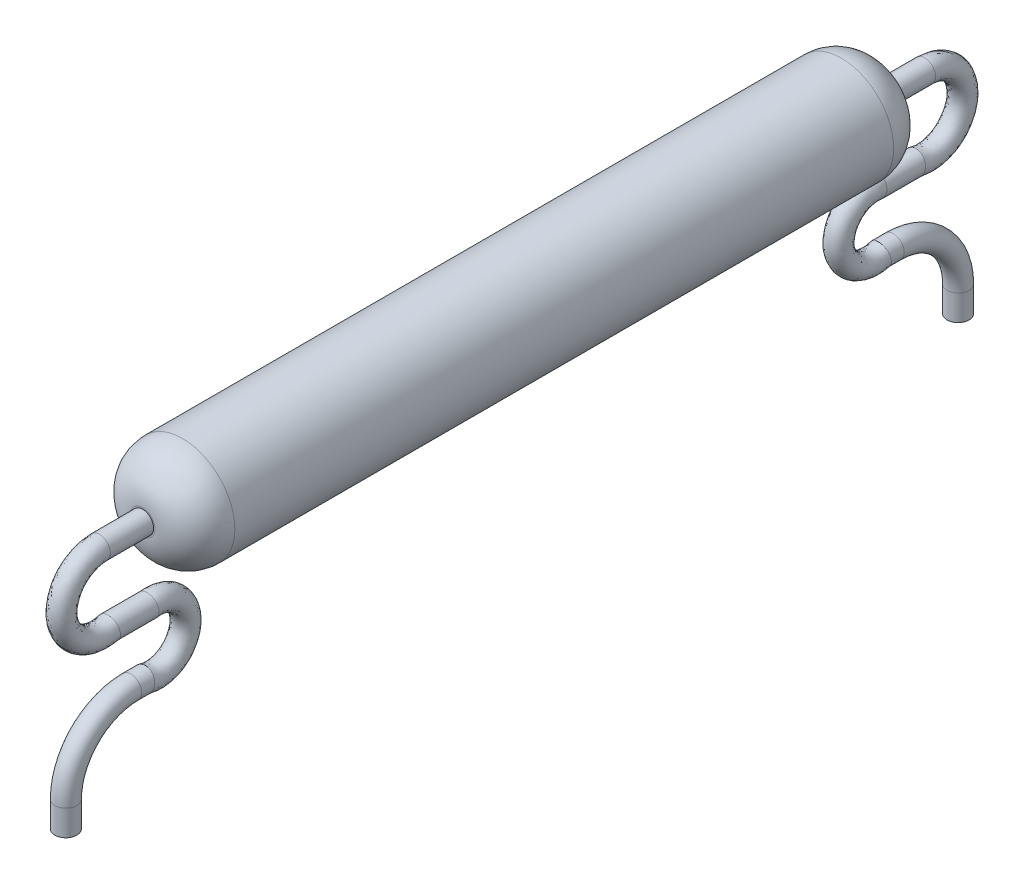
ISO-10303-21;
HEADER;
FILE_DESCRIPTION(('STEP AP214'),'2;1');
FILE_NAME('part.step','',(''),(''),'','','');
FILE_SCHEMA(('AUTOMOTIVE_DESIGN { 1 0 10303 214 1 1 1 1 }'));
ENDSEC;
DATA;
#1=APPLICATION_CONTEXT('core data for automotive mechanical design processes');
#2=APPLICATION_PROTOCOL_DEFINITION('international standard','automotive_design',2000,#1);
#3=PRODUCT_CONTEXT('',#1,'mechanical');
#4=PRODUCT('Part','Part','',(#3));
#5=PRODUCT_RELATED_PRODUCT_CATEGORY('part','',(#4));
#6=PRODUCT_DEFINITION_FORMATION('','',#4);
#7=PRODUCT_DEFINITION_CONTEXT('part definition',#1,'design');
#8=PRODUCT_DEFINITION('design','',#6,#7);
#9=PRODUCT_DEFINITION_SHAPE('','',#8);
#10=(LENGTH_UNIT() NAMED_UNIT(*) SI_UNIT(.MILLI.,.METRE.));
#11=(NAMED_UNIT(*) PLANE_ANGLE_UNIT() SI_UNIT($,.RADIAN.));
#12=(NAMED_UNIT(*) SI_UNIT($,.STERADIAN.) SOLID_ANGLE_UNIT());
#13=UNCERTAINTY_MEASURE_WITH_UNIT(LENGTH_MEASURE(1.E-05),#10,'distance_accuracy_value','');
#14=(GEOMETRIC_REPRESENTATION_CONTEXT(3) GLOBAL_UNCERTAINTY_ASSIGNED_CONTEXT((#13)) GLOBAL_UNIT_ASSIGNED_CONTEXT((#10,
#11,#12)) REPRESENTATION_CONTEXT('',''));
#15=CARTESIAN_POINT('',(0.,0.,0.));
#16=DIRECTION('',(0.,0.,1.));
#17=DIRECTION('',(1.,0.,0.));
#18=AXIS2_PLACEMENT_3D('',#15,#16,#17);
#19=CARTESIAN_POINT('',(-4.44089209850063E-13,1.77635683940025E-12,9.39800000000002));
#20=DIRECTION('',(0.,0.,0.999999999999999));
#21=DIRECTION('',(1.,0.,0.));
#22=AXIS2_PLACEMENT_3D('',#19,#20,#21);
#23=PLANE('',#22);
#24=CARTESIAN_POINT('',(-4.44089209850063E-13,1.77635683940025E-12,9.39800000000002));
#25=DIRECTION('',(0.,0.,0.999999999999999));
#26=DIRECTION('',(1.,0.,0.));
#27=AXIS2_PLACEMENT_3D('',#24,#25,#26);
#28=CIRCLE('',#27,0.314);
#29=CARTESIAN_POINT('',(0.313999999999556,1.77630454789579E-12,9.39800000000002));
#30=VERTEX_POINT('',#29);
#31=EDGE_CURVE('E11',#30,#30,#28,.T.);
#32=ORIENTED_EDGE('',*,*,#31,.T.);
#33=EDGE_LOOP('',(#32));
#34=FACE_BOUND('',#33,.T.);
#35=CARTESIAN_POINT('',(-4.44089209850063E-13,1.77635683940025E-12,9.39800000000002));
#36=DIRECTION('',(0.,0.,0.999999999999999));
#37=DIRECTION('',(1.,0.,0.));
#38=AXIS2_PLACEMENT_3D('',#35,#36,#37);
#39=CIRCLE('',#38,0.279399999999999);
#40=CARTESIAN_POINT('',(-0.2794,8.88224949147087E-13,9.39800000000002));
#41=VERTEX_POINT('',#40);
#42=EDGE_CURVE('E78',#41,#41,#39,.T.);
#43=ORIENTED_EDGE('',*,*,#42,.F.);
#44=EDGE_LOOP('',(#43));
#45=FACE_BOUND('',#44,.T.);
#46=ADVANCED_FACE('F58',(#34,#45),#23,.T.);
#47=CARTESIAN_POINT('',(-4.44089209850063E-13,8.88178419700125E-13,-9.39800000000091));
#48=DIRECTION('',(0.,0.,0.999999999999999));
#49=DIRECTION('',(1.,0.,0.));
#50=AXIS2_PLACEMENT_3D('',#47,#48,#49);
#51=CYLINDRICAL_SURFACE('',#50,1.33);
#52=CARTESIAN_POINT('',(-4.44089209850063E-13,0.,-8.382000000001));
#53=DIRECTION('',(0.,0.,0.999999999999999));
#54=DIRECTION('',(1.,0.,0.));
#55=AXIS2_PLACEMENT_3D('',#52,#53,#54);
#56=CIRCLE('',#55,1.33);
#57=CARTESIAN_POINT('',(1.32999999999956,8.87731332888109E-13,-8.382000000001));
#58=VERTEX_POINT('',#57);
#59=EDGE_CURVE('E69',#58,#58,#56,.T.);
#60=CARTESIAN_POINT('',(4.44089209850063E-13,2.66453525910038E-12,8.38199999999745));
#61=DIRECTION('',(0.,0.,0.999999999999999));
#62=DIRECTION('',(1.,0.,0.));
#63=AXIS2_PLACEMENT_3D('',#60,#61,#62);
#64=CIRCLE('',#63,1.33);
#65=CARTESIAN_POINT('',(1.32999999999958,8.84008977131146E-13,8.38199999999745));
#66=VERTEX_POINT('',#65);
#67=EDGE_CURVE('E73',#66,#66,#64,.F.);
#68=CARTESIAN_POINT('',(1.32999999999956,8.87731332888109E-13,-8.382000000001));
#69=CARTESIAN_POINT('',(1.32999999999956,8.87692558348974E-13,-8.20737500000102));
#70=CARTESIAN_POINT('',(1.32999999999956,8.87653783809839E-13,-8.03275000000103));
#71=CARTESIAN_POINT('',(1.32999999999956,8.87576234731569E-13,-7.68350000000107));
#72=CARTESIAN_POINT('',(1.32999999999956,8.87537460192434E-13,-7.50887500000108));
#73=CARTESIAN_POINT('',(1.32999999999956,8.87459911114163E-13,-7.15962500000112));
#74=CARTESIAN_POINT('',(1.32999999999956,8.87421136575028E-13,-6.98500000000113));
#75=CARTESIAN_POINT('',(1.32999999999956,8.87343587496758E-13,-6.63575000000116));
#76=CARTESIAN_POINT('',(1.32999999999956,8.87304812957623E-13,-6.46112500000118));
#77=CARTESIAN_POINT('',(1.32999999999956,8.87227263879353E-13,-6.11187500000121));
#78=CARTESIAN_POINT('',(1.32999999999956,8.87188489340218E-13,-5.93725000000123));
#79=CARTESIAN_POINT('',(1.32999999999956,8.87110940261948E-13,-5.58800000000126));
#80=CARTESIAN_POINT('',(1.32999999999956,8.87072165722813E-13,-5.41337500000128));
#81=CARTESIAN_POINT('',(1.32999999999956,8.86994616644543E-13,-5.06412500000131));
#82=CARTESIAN_POINT('',(1.32999999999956,8.86955842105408E-13,-4.88950000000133));
#83=CARTESIAN_POINT('',(1.32999999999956,8.86878293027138E-13,-4.54025000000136));
#84=CARTESIAN_POINT('',(1.32999999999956,8.86839518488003E-13,-4.36562500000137));
#85=CARTESIAN_POINT('',(1.32999999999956,8.86761969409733E-13,-4.01637500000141));
#86=CARTESIAN_POINT('',(1.32999999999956,8.86723194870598E-13,-3.84175000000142));
#87=CARTESIAN_POINT('',(1.32999999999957,8.86645645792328E-13,-3.49250000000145));
#88=CARTESIAN_POINT('',(1.32999999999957,8.86606871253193E-13,-3.31787500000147));
#89=CARTESIAN_POINT('',(1.32999999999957,8.86529322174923E-13,-2.9686250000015));
#90=CARTESIAN_POINT('',(1.32999999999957,8.86490547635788E-13,-2.79400000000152));
#91=CARTESIAN_POINT('',(1.32999999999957,8.86412998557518E-13,-2.44475000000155));
#92=CARTESIAN_POINT('',(1.32999999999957,8.86374224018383E-13,-2.27012500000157));
#93=CARTESIAN_POINT('',(1.32999999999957,8.86296674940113E-13,-1.9208750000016));
#94=CARTESIAN_POINT('',(1.32999999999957,8.86257900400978E-13,-1.74625000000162));
#95=CARTESIAN_POINT('',(1.32999999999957,8.86180351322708E-13,-1.39700000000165));
#96=CARTESIAN_POINT('',(1.32999999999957,8.86141576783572E-13,-1.22237500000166));
#97=CARTESIAN_POINT('',(1.32999999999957,8.86064027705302E-13,-0.873125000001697));
#98=CARTESIAN_POINT('',(1.32999999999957,8.86025253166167E-13,-0.698500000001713));
#99=CARTESIAN_POINT('',(1.32999999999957,8.85947704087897E-13,-0.349250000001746));
#100=CARTESIAN_POINT('',(1.32999999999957,8.85908929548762E-13,-0.174625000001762));
#101=CARTESIAN_POINT('',(1.32999999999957,8.85831380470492E-13,0.174624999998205));
#102=CARTESIAN_POINT('',(1.32999999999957,8.85792605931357E-13,0.349249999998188));
#103=CARTESIAN_POINT('',(1.32999999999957,8.85715056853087E-13,0.698499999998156));
#104=CARTESIAN_POINT('',(1.32999999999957,8.85676282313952E-13,0.87312499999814));
#105=CARTESIAN_POINT('',(1.32999999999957,8.85598733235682E-13,1.22237499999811));
#106=CARTESIAN_POINT('',(1.32999999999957,8.85559958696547E-13,1.39699999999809));
#107=CARTESIAN_POINT('',(1.32999999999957,8.85482409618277E-13,1.74624999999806));
#108=CARTESIAN_POINT('',(1.32999999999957,8.85443635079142E-13,1.92087499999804));
#109=CARTESIAN_POINT('',(1.32999999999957,8.85366086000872E-13,2.27012499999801));
#110=CARTESIAN_POINT('',(1.32999999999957,8.85327311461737E-13,2.444749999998));
#111=CARTESIAN_POINT('',(1.32999999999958,8.85249762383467E-13,2.79399999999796));
#112=CARTESIAN_POINT('',(1.32999999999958,8.85210987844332E-13,2.96862499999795));
#113=CARTESIAN_POINT('',(1.32999999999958,8.85133438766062E-13,3.31787499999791));
#114=CARTESIAN_POINT('',(1.32999999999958,8.85094664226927E-13,3.4924999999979));
#115=CARTESIAN_POINT('',(1.32999999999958,8.85017115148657E-13,3.84174999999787));
#116=CARTESIAN_POINT('',(1.32999999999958,8.84978340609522E-13,4.01637499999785));
#117=CARTESIAN_POINT('',(1.32999999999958,8.84900791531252E-13,4.36562499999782));
#118=CARTESIAN_POINT('',(1.32999999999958,8.84862016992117E-13,4.5402499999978));
#119=CARTESIAN_POINT('',(1.32999999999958,8.84784467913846E-13,4.88949999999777));
#120=CARTESIAN_POINT('',(1.32999999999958,8.84745693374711E-13,5.06412499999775));
#121=CARTESIAN_POINT('',(1.32999999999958,8.84668144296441E-13,5.41337499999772));
#122=CARTESIAN_POINT('',(1.32999999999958,8.84629369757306E-13,5.5879999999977));
#123=CARTESIAN_POINT('',(1.32999999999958,8.84551820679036E-13,5.93724999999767));
#124=CARTESIAN_POINT('',(1.32999999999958,8.84513046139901E-13,6.11187499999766));
#125=CARTESIAN_POINT('',(1.32999999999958,8.84435497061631E-13,6.46112499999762));
#126=CARTESIAN_POINT('',(1.32999999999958,8.84396722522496E-13,6.63574999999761));
#127=CARTESIAN_POINT('',(1.32999999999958,8.84319173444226E-13,6.98499999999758));
#128=CARTESIAN_POINT('',(1.32999999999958,8.84280398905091E-13,7.15962499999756));
#129=CARTESIAN_POINT('',(1.32999999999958,8.84202849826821E-13,7.50887499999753));
#130=CARTESIAN_POINT('',(1.32999999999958,8.84164075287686E-13,7.68349999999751));
#131=CARTESIAN_POINT('',(1.32999999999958,8.84086526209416E-13,8.03274999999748));
#132=CARTESIAN_POINT('',(1.32999999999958,8.84047751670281E-13,8.20737499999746));
#133=CARTESIAN_POINT('',(1.32999999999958,8.84008977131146E-13,8.38199999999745));
#134=B_SPLINE_CURVE_WITH_KNOTS('',3,(#68,#69,#70,#71,#72,#73,#74,#75,#76,#77,#78,#79,#80,#81,
#82,#83,#84,#85,#86,#87,#88,#89,#90,#91,#92,#93,#94,#95,#96,#97,#98,#99,#100,#101,#102,#103,
#104,#105,#106,#107,#108,#109,#110,#111,#112,#113,#114,#115,#116,#117,#118,#119,#120,#121,#122,
#123,#124,#125,#126,#127,#128,#129,#130,#131,#132,#133),.UNSPECIFIED.,.F.,.F.,(4,2,2,2,2,2,2,2,
2,2,2,2,2,2,2,2,2,2,2,2,2,2,2,2,2,2,2,2,2,2,2,2,4),(0.,0.523874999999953,1.0477499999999,
1.57162499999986,2.09549999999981,2.61937499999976,3.14324999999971,3.66712499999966,
4.19099999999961,4.71487499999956,5.23874999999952,5.76262499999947,6.28649999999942,
6.81037499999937,7.33424999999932,7.85812499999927,8.38199999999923,8.90587499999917,
9.42974999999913,9.95362499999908,10.477499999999,11.001374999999,11.5252499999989,
12.0491249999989,12.5729999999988,13.0968749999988,13.6207499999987,14.1446249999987,
14.6684999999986,15.1923749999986,15.7162499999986,16.2401249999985,16.7639999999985),.UNSPECIFIED.);
#135=EDGE_CURVE('BSEAM112',#58,#66,#134,.T.);
#136=ORIENTED_EDGE('',*,*,#59,.T.);
#137=ORIENTED_EDGE('',*,*,#67,.T.);
#138=ORIENTED_EDGE('',*,*,#135,.T.);
#139=ORIENTED_EDGE('',*,*,#135,.F.);
#140=EDGE_LOOP('',(#136,#138,#137,#139));
#141=FACE_BOUND('',#140,.T.);
#142=ADVANCED_FACE('F112',(#141),#51,.T.);
#143=CARTESIAN_POINT('',(-4.44089209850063E-13,8.88178419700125E-13,-9.39800000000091));
#144=DIRECTION('',(0.,0.,0.999999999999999));
#145=DIRECTION('',(1.,0.,0.));
#146=AXIS2_PLACEMENT_3D('',#143,#144,#145);
#147=PLANE('',#146);
#148=CARTESIAN_POINT('',(-4.44089209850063E-13,8.88178419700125E-13,-9.39800000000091));
#149=DIRECTION('',(0.,0.,0.999999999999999));
#150=DIRECTION('',(1.,0.,0.));
#151=AXIS2_PLACEMENT_3D('',#148,#149,#150);
#152=CIRCLE('',#151,0.314);
#153=CARTESIAN_POINT('',(0.313999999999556,8.88126128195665E-13,-9.39800000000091));
#154=VERTEX_POINT('',#153);
#155=EDGE_CURVE('E65',#154,#154,#152,.F.);
#156=ORIENTED_EDGE('',*,*,#155,.T.);
#157=EDGE_LOOP('',(#156));
#158=FACE_BOUND('',#157,.T.);
#159=CARTESIAN_POINT('',(-4.44089209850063E-13,8.88178419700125E-13,-9.39800000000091));
#160=DIRECTION('',(0.,0.,0.999999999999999));
#161=DIRECTION('',(1.,0.,0.));
#162=AXIS2_PLACEMENT_3D('',#159,#160,#161);
#163=CIRCLE('',#162,0.279399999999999);
#164=CARTESIAN_POINT('',(0.279399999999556,0.,-9.39800000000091));
#165=VERTEX_POINT('',#164);
#166=EDGE_CURVE('E81',#165,#165,#163,.T.);
#167=ORIENTED_EDGE('',*,*,#166,.T.);
#168=EDGE_LOOP('',(#167));
#169=FACE_BOUND('',#168,.T.);
#170=ADVANCED_FACE('F108',(#158,#169),#147,.F.);
#171=CARTESIAN_POINT('',(0.,8.88178419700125E-13,10.1599999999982));
#172=DIRECTION('',(0.,0.,-0.999999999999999));
#173=DIRECTION('',(-1.,0.,0.));
#174=AXIS2_PLACEMENT_3D('',#171,#172,#173);
#175=CYLINDRICAL_SURFACE('',#174,0.279399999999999);
#176=CARTESIAN_POINT('',(-4.44089209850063E-13,2.66453525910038E-12,10.5005037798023));
#177=DIRECTION('',(0.,0.,0.999999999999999));
#178=DIRECTION('',(1.,0.,0.));
#179=AXIS2_PLACEMENT_3D('',#176,#177,#178);
#180=CIRCLE('',#179,0.279399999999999);
#181=CARTESIAN_POINT('',(-0.279399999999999,8.88224949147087E-13,10.5005037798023));
#182=VERTEX_POINT('',#181);
#183=EDGE_CURVE('E91',#182,#182,#180,.T.);
#184=CARTESIAN_POINT('',(-0.2794,8.88224949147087E-13,9.39800000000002));
#185=CARTESIAN_POINT('',(-0.2794,8.88224949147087E-13,9.40948441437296));
#186=CARTESIAN_POINT('',(-0.2794,8.88224949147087E-13,9.4209688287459));
#187=CARTESIAN_POINT('',(-0.2794,8.88224949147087E-13,9.44393765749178));
#188=CARTESIAN_POINT('',(-0.2794,8.88224949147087E-13,9.45542207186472));
#189=CARTESIAN_POINT('',(-0.2794,8.88224949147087E-13,9.4783909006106));
#190=CARTESIAN_POINT('',(-0.2794,8.88224949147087E-13,9.48987531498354));
#191=CARTESIAN_POINT('',(-0.2794,8.88224949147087E-13,9.51284414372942));
#192=CARTESIAN_POINT('',(-0.2794,8.88224949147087E-13,9.52432855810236));
#193=CARTESIAN_POINT('',(-0.2794,8.88224949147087E-13,9.54729738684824));
#194=CARTESIAN_POINT('',(-0.2794,8.88224949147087E-13,9.55878180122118));
#195=CARTESIAN_POINT('',(-0.2794,8.88224949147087E-13,9.58175062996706));
#196=CARTESIAN_POINT('',(-0.2794,8.88224949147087E-13,9.59323504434));
#197=CARTESIAN_POINT('',(-0.2794,8.88224949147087E-13,9.61620387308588));
#198=CARTESIAN_POINT('',(-0.2794,8.88224949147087E-13,9.62768828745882));
#199=CARTESIAN_POINT('',(-0.2794,8.88224949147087E-13,9.6506571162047));
#200=CARTESIAN_POINT('',(-0.2794,8.88224949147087E-13,9.66214153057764));
#201=CARTESIAN_POINT('',(-0.2794,8.88224949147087E-13,9.68511035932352));
#202=CARTESIAN_POINT('',(-0.2794,8.88224949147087E-13,9.69659477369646));
#203=CARTESIAN_POINT('',(-0.2794,8.88224949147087E-13,9.71956360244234));
#204=CARTESIAN_POINT('',(-0.2794,8.88224949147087E-13,9.73104801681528));
#205=CARTESIAN_POINT('',(-0.2794,8.88224949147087E-13,9.75401684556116));
#206=CARTESIAN_POINT('',(-0.2794,8.88224949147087E-13,9.7655012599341));
#207=CARTESIAN_POINT('',(-0.2794,8.88224949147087E-13,9.78847008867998));
#208=CARTESIAN_POINT('',(-0.2794,8.88224949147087E-13,9.79995450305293));
#209=CARTESIAN_POINT('',(-0.2794,8.88224949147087E-13,9.8229233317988));
#210=CARTESIAN_POINT('',(-0.2794,8.88224949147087E-13,9.83440774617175));
#211=CARTESIAN_POINT('',(-0.2794,8.88224949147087E-13,9.85737657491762));
#212=CARTESIAN_POINT('',(-0.2794,8.88224949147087E-13,9.86886098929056));
#213=CARTESIAN_POINT('',(-0.2794,8.88224949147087E-13,9.89182981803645));
#214=CARTESIAN_POINT('',(-0.279399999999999,8.88224949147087E-13,9.90331423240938));
#215=CARTESIAN_POINT('',(-0.279399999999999,8.88224949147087E-13,9.92628306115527));
#216=CARTESIAN_POINT('',(-0.279399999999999,8.88224949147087E-13,9.93776747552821));
#217=CARTESIAN_POINT('',(-0.279399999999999,8.88224949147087E-13,9.96073630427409));
#218=CARTESIAN_POINT('',(-0.279399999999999,8.88224949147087E-13,9.97222071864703));
#219=CARTESIAN_POINT('',(-0.279399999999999,8.88224949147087E-13,9.99518954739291));
#220=CARTESIAN_POINT('',(-0.279399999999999,8.88224949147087E-13,10.0066739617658));
#221=CARTESIAN_POINT('',(-0.279399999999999,8.88224949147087E-13,10.0296427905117));
#222=CARTESIAN_POINT('',(-0.279399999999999,8.88224949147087E-13,10.0411272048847));
#223=CARTESIAN_POINT('',(-0.279399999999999,8.88224949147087E-13,10.0640960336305));
#224=CARTESIAN_POINT('',(-0.279399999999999,8.88224949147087E-13,10.0755804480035));
#225=CARTESIAN_POINT('',(-0.279399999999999,8.88224949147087E-13,10.0985492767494));
#226=CARTESIAN_POINT('',(-0.279399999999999,8.88224949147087E-13,10.1100336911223));
#227=CARTESIAN_POINT('',(-0.279399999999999,8.88224949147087E-13,10.1330025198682));
#228=CARTESIAN_POINT('',(-0.279399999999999,8.88224949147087E-13,10.1444869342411));
#229=CARTESIAN_POINT('',(-0.279399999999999,8.88224949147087E-13,10.167455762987));
#230=CARTESIAN_POINT('',(-0.279399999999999,8.88224949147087E-13,10.1789401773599));
#231=CARTESIAN_POINT('',(-0.279399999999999,8.88224949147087E-13,10.2019090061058));
#232=CARTESIAN_POINT('',(-0.279399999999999,8.88224949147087E-13,10.2133934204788));
#233=CARTESIAN_POINT('',(-0.279399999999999,8.88224949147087E-13,10.2363622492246));
#234=CARTESIAN_POINT('',(-0.279399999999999,8.88224949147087E-13,10.2478466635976));
#235=CARTESIAN_POINT('',(-0.279399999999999,8.88224949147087E-13,10.2708154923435));
#236=CARTESIAN_POINT('',(-0.279399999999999,8.88224949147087E-13,10.2822999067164));
#237=CARTESIAN_POINT('',(-0.279399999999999,8.88224949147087E-13,10.3052687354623));
#238=CARTESIAN_POINT('',(-0.279399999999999,8.88224949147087E-13,10.3167531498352));
#239=CARTESIAN_POINT('',(-0.279399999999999,8.88224949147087E-13,10.3397219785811));
#240=CARTESIAN_POINT('',(-0.279399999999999,8.88224949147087E-13,10.3512063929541));
#241=CARTESIAN_POINT('',(-0.279399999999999,8.88224949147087E-13,10.3741752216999));
#242=CARTESIAN_POINT('',(-0.279399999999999,8.88224949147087E-13,10.3856596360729));
#243=CARTESIAN_POINT('',(-0.279399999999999,8.88224949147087E-13,10.4086284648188));
#244=CARTESIAN_POINT('',(-0.279399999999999,8.88224949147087E-13,10.4201128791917));
#245=CARTESIAN_POINT('',(-0.279399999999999,8.88224949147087E-13,10.4430817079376));
#246=CARTESIAN_POINT('',(-0.279399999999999,8.88224949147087E-13,10.4545661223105));
#247=CARTESIAN_POINT('',(-0.279399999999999,8.88224949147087E-13,10.4775349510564));
#248=CARTESIAN_POINT('',(-0.279399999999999,8.88224949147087E-13,10.4890193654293));
#249=CARTESIAN_POINT('',(-0.279399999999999,8.88224949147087E-13,10.5005037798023));
#250=B_SPLINE_CURVE_WITH_KNOTS('',3,(#184,#185,#186,#187,#188,#189,#190,#191,#192,#193,#194,
#195,#196,#197,#198,#199,#200,#201,#202,#203,#204,#205,#206,#207,#208,#209,#210,#211,#212,#213,
#214,#215,#216,#217,#218,#219,#220,#221,#222,#223,#224,#225,#226,#227,#228,#229,#230,#231,#232,
#233,#234,#235,#236,#237,#238,#239,#240,#241,#242,#243,#244,#245,#246,#247,#248,#249),
.UNSPECIFIED.,.F.,.F.,(4,2,2,2,2,2,2,2,2,2,2,2,2,2,2,2,2,2,2,2,2,2,2,2,2,2,2,2,2,2,2,2,4),(0.,
0.0344532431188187,0.068906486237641,0.10335972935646,0.137812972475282,0.172266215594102,
0.206719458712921,0.241172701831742,0.275625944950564,0.310079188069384,0.344532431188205,
0.378985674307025,0.413438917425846,0.447892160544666,0.482345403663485,0.516798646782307,
0.551251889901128,0.585705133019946,0.620158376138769,0.654611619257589,0.68906486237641,
0.72351810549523,0.75797134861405,0.792424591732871,0.826877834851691,0.86133107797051,
0.895784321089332,0.930237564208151,0.964690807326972,0.999144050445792,1.03359729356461,
1.06805053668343,1.10250377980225),.UNSPECIFIED.);
#251=EDGE_CURVE('BSEAM104',#41,#182,#250,.T.);
#252=ORIENTED_EDGE('',*,*,#42,.T.);
#253=ORIENTED_EDGE('',*,*,#183,.F.);
#254=ORIENTED_EDGE('',*,*,#251,.T.);
#255=ORIENTED_EDGE('',*,*,#251,.F.);
#256=EDGE_LOOP('',(#252,#254,#253,#255));
#257=FACE_BOUND('',#256,.T.);
#258=ADVANCED_FACE('F104',(#257),#175,.T.);
#259=CARTESIAN_POINT('',(-4.44089209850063E-13,0.,-10.1599999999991));
#260=DIRECTION('',(0.,0.,0.999999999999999));
#261=DIRECTION('',(1.,0.,0.));
#262=AXIS2_PLACEMENT_3D('',#259,#260,#261);
#263=CYLINDRICAL_SURFACE('',#262,0.279399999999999);
#264=CARTESIAN_POINT('',(-8.88178419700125E-13,1.77635683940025E-12,-10.5005037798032));
#265=DIRECTION('',(0.,0.,0.999999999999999));
#266=DIRECTION('',(1.,0.,0.));
#267=AXIS2_PLACEMENT_3D('',#264,#265,#266);
#268=CIRCLE('',#267,0.279399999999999);
#269=CARTESIAN_POINT('',(0.279399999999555,0.,-10.5005037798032));
#270=VERTEX_POINT('',#269);
#271=EDGE_CURVE('E192',#270,#270,#268,.T.);
#272=CARTESIAN_POINT('',(0.279399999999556,0.,-9.39800000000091));
#273=CARTESIAN_POINT('',(0.279399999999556,0.,-9.40948441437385));
#274=CARTESIAN_POINT('',(0.279399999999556,0.,-9.42096882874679));
#275=CARTESIAN_POINT('',(0.279399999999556,0.,-9.44393765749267));
#276=CARTESIAN_POINT('',(0.279399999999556,0.,-9.45542207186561));
#277=CARTESIAN_POINT('',(0.279399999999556,0.,-9.47839090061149));
#278=CARTESIAN_POINT('',(0.279399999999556,0.,-9.48987531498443));
#279=CARTESIAN_POINT('',(0.279399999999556,0.,-9.51284414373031));
#280=CARTESIAN_POINT('',(0.279399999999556,0.,-9.52432855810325));
#281=CARTESIAN_POINT('',(0.279399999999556,0.,-9.54729738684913));
#282=CARTESIAN_POINT('',(0.279399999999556,0.,-9.55878180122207));
#283=CARTESIAN_POINT('',(0.279399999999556,0.,-9.58175062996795));
#284=CARTESIAN_POINT('',(0.279399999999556,0.,-9.59323504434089));
#285=CARTESIAN_POINT('',(0.279399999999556,0.,-9.61620387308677));
#286=CARTESIAN_POINT('',(0.279399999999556,0.,-9.62768828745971));
#287=CARTESIAN_POINT('',(0.279399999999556,0.,-9.65065711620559));
#288=CARTESIAN_POINT('',(0.279399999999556,0.,-9.66214153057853));
#289=CARTESIAN_POINT('',(0.279399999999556,0.,-9.68511035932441));
#290=CARTESIAN_POINT('',(0.279399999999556,0.,-9.69659477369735));
#291=CARTESIAN_POINT('',(0.279399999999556,0.,-9.71956360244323));
#292=CARTESIAN_POINT('',(0.279399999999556,0.,-9.73104801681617));
#293=CARTESIAN_POINT('',(0.279399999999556,0.,-9.75401684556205));
#294=CARTESIAN_POINT('',(0.279399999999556,0.,-9.76550125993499));
#295=CARTESIAN_POINT('',(0.279399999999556,0.,-9.78847008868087));
#296=CARTESIAN_POINT('',(0.279399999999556,0.,-9.79995450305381));
#297=CARTESIAN_POINT('',(0.279399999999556,0.,-9.82292333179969));
#298=CARTESIAN_POINT('',(0.279399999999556,0.,-9.83440774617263));
#299=CARTESIAN_POINT('',(0.279399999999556,0.,-9.85737657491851));
#300=CARTESIAN_POINT('',(0.279399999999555,0.,-9.86886098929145));
#301=CARTESIAN_POINT('',(0.279399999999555,0.,-9.89182981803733));
#302=CARTESIAN_POINT('',(0.279399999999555,0.,-9.90331423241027));
#303=CARTESIAN_POINT('',(0.279399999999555,0.,-9.92628306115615));
#304=CARTESIAN_POINT('',(0.279399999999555,0.,-9.9377674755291));
#305=CARTESIAN_POINT('',(0.279399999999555,0.,-9.96073630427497));
#306=CARTESIAN_POINT('',(0.279399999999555,0.,-9.97222071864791));
#307=CARTESIAN_POINT('',(0.279399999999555,0.,-9.99518954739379));
#308=CARTESIAN_POINT('',(0.279399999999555,0.,-10.0066739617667));
#309=CARTESIAN_POINT('',(0.279399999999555,0.,-10.0296427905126));
#310=CARTESIAN_POINT('',(0.279399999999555,0.,-10.0411272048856));
#311=CARTESIAN_POINT('',(0.279399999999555,0.,-10.0640960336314));
#312=CARTESIAN_POINT('',(0.279399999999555,0.,-10.0755804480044));
#313=CARTESIAN_POINT('',(0.279399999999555,0.,-10.0985492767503));
#314=CARTESIAN_POINT('',(0.279399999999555,0.,-10.1100336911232));
#315=CARTESIAN_POINT('',(0.279399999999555,0.,-10.1330025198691));
#316=CARTESIAN_POINT('',(0.279399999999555,0.,-10.144486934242));
#317=CARTESIAN_POINT('',(0.279399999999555,0.,-10.1674557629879));
#318=CARTESIAN_POINT('',(0.279399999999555,0.,-10.1789401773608));
#319=CARTESIAN_POINT('',(0.279399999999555,0.,-10.2019090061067));
#320=CARTESIAN_POINT('',(0.279399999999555,0.,-10.2133934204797));
#321=CARTESIAN_POINT('',(0.279399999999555,0.,-10.2363622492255));
#322=CARTESIAN_POINT('',(0.279399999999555,0.,-10.2478466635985));
#323=CARTESIAN_POINT('',(0.279399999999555,0.,-10.2708154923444));
#324=CARTESIAN_POINT('',(0.279399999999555,0.,-10.2822999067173));
#325=CARTESIAN_POINT('',(0.279399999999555,0.,-10.3052687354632));
#326=CARTESIAN_POINT('',(0.279399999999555,0.,-10.3167531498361));
#327=CARTESIAN_POINT('',(0.279399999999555,0.,-10.339721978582));
#328=CARTESIAN_POINT('',(0.279399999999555,0.,-10.3512063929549));
#329=CARTESIAN_POINT('',(0.279399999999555,0.,-10.3741752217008));
#330=CARTESIAN_POINT('',(0.279399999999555,0.,-10.3856596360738));
#331=CARTESIAN_POINT('',(0.279399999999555,0.,-10.4086284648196));
#332=CARTESIAN_POINT('',(0.279399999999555,0.,-10.4201128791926));
#333=CARTESIAN_POINT('',(0.279399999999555,0.,-10.4430817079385));
#334=CARTESIAN_POINT('',(0.279399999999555,0.,-10.4545661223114));
#335=CARTESIAN_POINT('',(0.279399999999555,0.,-10.4775349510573));
#336=CARTESIAN_POINT('',(0.279399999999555,0.,-10.4890193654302));
#337=CARTESIAN_POINT('',(0.279399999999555,0.,-10.5005037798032));
#338=B_SPLINE_CURVE_WITH_KNOTS('',3,(#272,#273,#274,#275,#276,#277,#278,#279,#280,#281,#282,
#283,#284,#285,#286,#287,#288,#289,#290,#291,#292,#293,#294,#295,#296,#297,#298,#299,#300,#301,
#302,#303,#304,#305,#306,#307,#308,#309,#310,#311,#312,#313,#314,#315,#316,#317,#318,#319,#320,
#321,#322,#323,#324,#325,#326,#327,#328,#329,#330,#331,#332,#333,#334,#335,#336,#337),
.UNSPECIFIED.,.F.,.F.,(4,2,2,2,2,2,2,2,2,2,2,2,2,2,2,2,2,2,2,2,2,2,2,2,2,2,2,2,2,2,2,2,4),(0.,
0.0344532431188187,0.068906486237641,0.10335972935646,0.137812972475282,0.172266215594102,
0.206719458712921,0.241172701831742,0.275625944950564,0.310079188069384,0.344532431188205,
0.378985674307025,0.413438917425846,0.447892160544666,0.482345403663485,0.516798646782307,
0.551251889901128,0.585705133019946,0.620158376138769,0.654611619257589,0.68906486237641,
0.72351810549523,0.75797134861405,0.792424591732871,0.826877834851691,0.86133107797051,
0.895784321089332,0.930237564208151,0.964690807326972,0.999144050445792,1.03359729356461,
1.06805053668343,1.10250377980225),.UNSPECIFIED.);
#339=EDGE_CURVE('BSEAM99',#165,#270,#338,.T.);
#340=ORIENTED_EDGE('',*,*,#166,.F.);
#341=ORIENTED_EDGE('',*,*,#271,.T.);
#342=ORIENTED_EDGE('',*,*,#339,.T.);
#343=ORIENTED_EDGE('',*,*,#339,.F.);
#344=EDGE_LOOP('',(#340,#342,#341,#343));
#345=FACE_BOUND('',#344,.T.);
#346=ADVANCED_FACE('F99',(#345),#263,.T.);
#347=CARTESIAN_POINT('',(4.44089209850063E-13,-5.13375176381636,11.3507035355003));
#348=DIRECTION('',(0.,-0.999984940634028,-0.00548803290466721));
#349=DIRECTION('',(0.,0.00548803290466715,-0.999984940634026));
#350=AXIS2_PLACEMENT_3D('',#347,#348,#349);
#351=CIRCLE('',#350,0.279399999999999);
#352=DIRECTION('',(0.,-1.,0.));
#353=VECTOR('',#352,1.);
#354=SURFACE_OF_LINEAR_EXTRUSION('',#351,#353);
#355=CARTESIAN_POINT('',(5.94570988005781E-13,-5.13528512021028,11.630099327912));
#356=VERTEX_POINT('',#355);
#357=EDGE_CURVE('E87',#356,#356,#351,.T.);
#358=ORIENTED_EDGE('',*,*,#357,.T.);
#359=EDGE_LOOP('',(#358));
#360=FACE_BOUND('',#359,.T.);
#361=CARTESIAN_POINT('',(-8.88178419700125E-13,-5.78598713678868,11.3507035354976));
#362=DIRECTION('',(0.,-0.999984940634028,-0.00548803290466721));
#363=DIRECTION('',(0.,0.00548803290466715,-0.999984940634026));
#364=AXIS2_PLACEMENT_3D('',#361,#362,#363);
#365=CIRCLE('',#364,0.279399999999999);
#366=CARTESIAN_POINT('',(-8.88550655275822E-13,-5.78445378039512,11.0713077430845));
#367=VERTEX_POINT('',#366);
#368=EDGE_CURVE('E84',#367,#367,#365,.T.);
#369=ORIENTED_EDGE('',*,*,#368,.F.);
#370=EDGE_LOOP('',(#369));
#371=FACE_BOUND('',#370,.T.);
#372=ADVANCED_FACE('F94',(#360,#371),#354,.T.);
#373=CARTESIAN_POINT('',(-4.44089209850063E-13,-5.12470153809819,9.70164464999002));
#374=DIRECTION('',(1.,0.,0.));
#375=DIRECTION('',(0.,0.,-0.999999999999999));
#376=AXIS2_PLACEMENT_3D('',#373,#374,#375);
#377=TOROIDAL_SURFACE('',#376,1.64908371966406,0.279399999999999);
#378=CARTESIAN_POINT('',(-4.44089209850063E-13,-3.47561781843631,9.70164464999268));
#379=DIRECTION('',(0.,0.,0.999999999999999));
#380=DIRECTION('',(0.,-1.,0.));
#381=AXIS2_PLACEMENT_3D('',#378,#379,#380);
#382=CIRCLE('',#381,0.279399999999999);
#383=CARTESIAN_POINT('',(-4.44089209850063E-13,-3.19621781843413,9.70164464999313));
#384=VERTEX_POINT('',#383);
#385=EDGE_CURVE('E201',#384,#384,#382,.T.);
#386=CARTESIAN_POINT('',(-4.44089209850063E-13,-5.12470153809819,9.70164464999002));
#387=DIRECTION('',(1.,0.,0.));
#388=DIRECTION('',(0.,0.,-0.999999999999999));
#389=AXIS2_PLACEMENT_3D('',#386,#387,#388);
#390=CIRCLE('',#389,1.92848371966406);
#391=EDGE_CURVE('',#384,#356,#390,.T.);
#392=ORIENTED_EDGE('',*,*,#385,.T.);
#393=ORIENTED_EDGE('',*,*,#357,.F.);
#394=ORIENTED_EDGE('',*,*,#391,.T.);
#395=ORIENTED_EDGE('',*,*,#391,.F.);
#396=EDGE_LOOP('',(#392,#394,#393,#395));
#397=FACE_BOUND('',#396,.T.);
#398=ADVANCED_FACE('F98',(#397),#377,.T.);
#399=CARTESIAN_POINT('',(0.279400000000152,3.5527136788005E-12,10.5005037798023));
#400=CARTESIAN_POINT('',(0.279399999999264,2.66453525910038E-12,10.563773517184));
#401=CARTESIAN_POINT('',(0.279400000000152,-0.0153175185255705,10.6949693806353));
#402=CARTESIAN_POINT('',(0.279399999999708,-0.0773640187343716,10.887670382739));
#403=CARTESIAN_POINT('',(0.279400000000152,-0.180336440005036,11.0724109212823));
#404=CARTESIAN_POINT('',(0.279399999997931,-0.324414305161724,11.2339011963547));
#405=CARTESIAN_POINT('',(0.279400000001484,-0.503982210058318,11.3547078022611));
#406=CARTESIAN_POINT('',(0.279399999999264,-0.700985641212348,11.4316327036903));
#407=CARTESIAN_POINT('',(0.279400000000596,-0.900371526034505,11.4669224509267));
#408=CARTESIAN_POINT('',(0.279399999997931,-1.09608737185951,11.4630189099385));
#409=CARTESIAN_POINT('',(0.279399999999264,-1.28563133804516,11.4141004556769));
#410=CARTESIAN_POINT('',(0.279400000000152,-1.46816084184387,11.3264473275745));
#411=CARTESIAN_POINT('',(0.279400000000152,-1.63718944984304,11.1993364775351));
#412=CARTESIAN_POINT('',(0.279399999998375,-1.77761514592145,11.0346572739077));
#413=CARTESIAN_POINT('',(0.27940000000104,-1.87290961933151,10.8403439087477));
#414=CARTESIAN_POINT('',(0.279399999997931,-1.92236002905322,10.6347171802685));
#415=CARTESIAN_POINT('',(0.279400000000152,-1.93024507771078,10.432353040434));
#416=CARTESIAN_POINT('',(0.279400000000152,-1.90968909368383,10.3019409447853));
#417=CARTESIAN_POINT('',(0.279400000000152,-1.89265971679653,10.2410060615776));
#418=CARTESIAN_POINT('',(0.279400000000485,0.55880000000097,10.500503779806));
#419=CARTESIAN_POINT('',(0.279399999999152,0.558800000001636,10.563773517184));
#420=CARTESIAN_POINT('',(0.279400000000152,0.533539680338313,10.8389127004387));
#421=CARTESIAN_POINT('',(0.279400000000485,0.438334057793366,11.1054534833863));
#422=CARTESIAN_POINT('',(0.279399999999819,0.280386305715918,11.3985417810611));
#423=CARTESIAN_POINT('',(0.279399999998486,0.0466901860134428,11.6589224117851));
#424=CARTESIAN_POINT('',(0.279399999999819,-0.245053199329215,11.8553559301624));
#425=CARTESIAN_POINT('',(0.279399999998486,-0.54956171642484,11.9728877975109));
#426=CARTESIAN_POINT('',(0.279400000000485,-0.852193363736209,12.0275266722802));
#427=CARTESIAN_POINT('',(0.279399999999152,-1.17264584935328,12.0213985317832));
#428=CARTESIAN_POINT('',(0.279399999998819,-1.48291746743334,11.9410372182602));
#429=CARTESIAN_POINT('',(0.279399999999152,-1.75969319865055,11.807024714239));
#430=CARTESIAN_POINT('',(0.279399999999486,-2.02125690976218,11.6116085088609));
#431=CARTESIAN_POINT('',(0.279399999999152,-2.24964431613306,11.344907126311));
#432=CARTESIAN_POINT('',(0.279400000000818,-2.40358687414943,11.0274873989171));
#433=CARTESIAN_POINT('',(0.279399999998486,-2.48058972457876,10.716201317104));
#434=CARTESIAN_POINT('',(0.279399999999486,-2.48733920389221,10.3865451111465));
#435=CARTESIAN_POINT('',(0.279399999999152,-2.46848909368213,10.2253253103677));
#436=CARTESIAN_POINT('',(0.279399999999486,-2.45145971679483,10.1643904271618));
#437=CARTESIAN_POINT('',(-0.279400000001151,0.5588000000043,10.500503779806));
#438=CARTESIAN_POINT('',(-0.279400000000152,0.558800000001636,10.5637735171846));
#439=CARTESIAN_POINT('',(-0.279400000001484,0.533539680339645,10.8389127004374));
#440=CARTESIAN_POINT('',(-0.279400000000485,0.43833405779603,11.1054534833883));
#441=CARTESIAN_POINT('',(-0.279400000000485,0.280386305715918,11.3985417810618));
#442=CARTESIAN_POINT('',(-0.279400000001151,0.0466901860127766,11.6589224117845));
#443=CARTESIAN_POINT('',(-0.279399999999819,-0.245053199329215,11.8553559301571));
#444=CARTESIAN_POINT('',(-0.279400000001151,-0.549561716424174,11.9728877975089));
#445=CARTESIAN_POINT('',(-0.279400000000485,-0.852193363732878,12.0275266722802));
#446=CARTESIAN_POINT('',(-0.279400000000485,-1.17264584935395,12.0213985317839));
#447=CARTESIAN_POINT('',(-0.279400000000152,-1.48291746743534,11.9410372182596));
#448=CARTESIAN_POINT('',(-0.279400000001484,-1.75969319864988,11.8070247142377));
#449=CARTESIAN_POINT('',(-0.279400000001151,-2.02125690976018,11.6116085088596));
#450=CARTESIAN_POINT('',(-0.279400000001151,-2.24964431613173,11.3449071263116));
#451=CARTESIAN_POINT('',(-0.279399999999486,-2.40358687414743,11.0274873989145));
#452=CARTESIAN_POINT('',(-0.279400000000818,-2.48058972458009,10.7162013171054));
#453=CARTESIAN_POINT('',(-0.279399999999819,-2.48733920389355,10.3865451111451));
#454=CARTESIAN_POINT('',(-0.279400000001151,-2.46848909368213,10.225325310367));
#455=CARTESIAN_POINT('',(-0.279400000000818,-2.4514597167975,10.1643904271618));
#456=CARTESIAN_POINT('',(-0.27940000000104,8.88178419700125E-13,10.5005037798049));
#457=CARTESIAN_POINT('',(-0.279400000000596,3.5527136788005E-12,10.5637735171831));
#458=CARTESIAN_POINT('',(-0.279400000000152,-0.0153175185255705,10.6949693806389));
#459=CARTESIAN_POINT('',(-0.279400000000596,-0.0773640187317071,10.8876703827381));
#460=CARTESIAN_POINT('',(-0.279399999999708,-0.180336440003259,11.0724109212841));
#461=CARTESIAN_POINT('',(-0.279400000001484,-0.324414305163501,11.2339011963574));
#462=CARTESIAN_POINT('',(-0.279399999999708,-0.503982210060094,11.3547078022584));
#463=CARTESIAN_POINT('',(-0.279400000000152,-0.700985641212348,11.4316327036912));
#464=CARTESIAN_POINT('',(-0.279400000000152,-0.900371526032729,11.4669224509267));
#465=CARTESIAN_POINT('',(-0.27940000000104,-1.09608737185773,11.4630189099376));
#466=CARTESIAN_POINT('',(-0.279399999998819,-1.28563133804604,11.4141004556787));
#467=CARTESIAN_POINT('',(-0.27940000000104,-1.46816084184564,11.3264473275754));
#468=CARTESIAN_POINT('',(-0.27940000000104,-1.63718944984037,11.1993364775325));
#469=CARTESIAN_POINT('',(-0.279400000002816,-1.77761514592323,11.0346572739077));
#470=CARTESIAN_POINT('',(-0.27939999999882,-1.87290961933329,10.8403439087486));
#471=CARTESIAN_POINT('',(-0.279400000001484,-1.92236002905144,10.6347171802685));
#472=CARTESIAN_POINT('',(-0.279399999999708,-1.93024507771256,10.4323530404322));
#473=CARTESIAN_POINT('',(-0.279400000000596,-1.90968909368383,10.3019409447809));
#474=CARTESIAN_POINT('',(-0.279399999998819,-1.89265971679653,10.2410060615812));
#475=CARTESIAN_POINT('',(-0.279400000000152,-0.558799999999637,10.5005037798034));
#476=CARTESIAN_POINT('',(-0.279400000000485,-0.558799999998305,10.5637735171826));
#477=CARTESIAN_POINT('',(-0.279400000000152,-0.564174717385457,10.5510260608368));
#478=CARTESIAN_POINT('',(-0.279400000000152,-0.593062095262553,10.6698872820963));
#479=CARTESIAN_POINT('',(-0.279400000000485,-0.641059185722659,10.7462800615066));
#480=CARTESIAN_POINT('',(-0.279400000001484,-0.695518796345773,10.8088799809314));
#481=CARTESIAN_POINT('',(-0.279400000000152,-0.762911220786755,10.8540596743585));
#482=CARTESIAN_POINT('',(-0.279400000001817,-0.852409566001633,10.8903776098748));
#483=CARTESIAN_POINT('',(-0.279400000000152,-0.948549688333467,10.9063182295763));
#484=CARTESIAN_POINT('',(-0.279400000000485,-1.01952889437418,10.9046392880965));
#485=CARTESIAN_POINT('',(-0.279400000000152,-1.0883452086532,10.8871636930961));
#486=CARTESIAN_POINT('',(-0.279400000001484,-1.17662848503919,10.8458699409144));
#487=CARTESIAN_POINT('',(-0.279400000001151,-1.25312198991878,10.7870644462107));
#488=CARTESIAN_POINT('',(-0.279400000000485,-1.3055859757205,10.7244074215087));
#489=CARTESIAN_POINT('',(-0.279400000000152,-1.3422323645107,10.6532004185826));
#490=CARTESIAN_POINT('',(-0.279400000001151,-1.36413033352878,10.5532330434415));
#491=CARTESIAN_POINT('',(-0.279400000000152,-1.37315095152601,10.4781609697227));
#492=CARTESIAN_POINT('',(-0.279400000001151,-1.35088909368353,10.3785565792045));
#493=CARTESIAN_POINT('',(-0.279400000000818,-1.33385971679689,10.3176216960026));
#494=CARTESIAN_POINT('',(0.279400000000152,-0.558799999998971,10.5005037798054));
#495=CARTESIAN_POINT('',(0.279399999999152,-0.558799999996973,10.563773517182));
#496=CARTESIAN_POINT('',(0.279399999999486,-0.564174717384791,10.5510260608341));
#497=CARTESIAN_POINT('',(0.279400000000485,-0.593062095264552,10.6698872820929));
#498=CARTESIAN_POINT('',(0.279400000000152,-0.641059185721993,10.7462800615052));
#499=CARTESIAN_POINT('',(0.279399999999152,-0.695518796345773,10.8088799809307));
#500=CARTESIAN_POINT('',(0.279399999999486,-0.762911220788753,10.8540596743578));
#501=CARTESIAN_POINT('',(0.279399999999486,-0.852409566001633,10.8903776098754));
#502=CARTESIAN_POINT('',(0.279399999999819,-0.948549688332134,10.906318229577));
#503=CARTESIAN_POINT('',(0.279399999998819,-1.01952889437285,10.9046392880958));
#504=CARTESIAN_POINT('',(0.279399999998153,-1.08834520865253,10.8871636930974));
#505=CARTESIAN_POINT('',(0.279399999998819,-1.17662848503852,10.8458699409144));
#506=CARTESIAN_POINT('',(0.279399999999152,-1.25312198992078,10.7870644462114));
#507=CARTESIAN_POINT('',(0.279399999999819,-1.3055859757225,10.7244074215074));
#508=CARTESIAN_POINT('',(0.279400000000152,-1.34223236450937,10.653200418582));
#509=CARTESIAN_POINT('',(0.279399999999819,-1.36413033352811,10.5532330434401));
#510=CARTESIAN_POINT('',(0.279399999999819,-1.37315095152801,10.4781609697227));
#511=CARTESIAN_POINT('',(0.279399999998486,-1.35088909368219,10.3785565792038));
#512=CARTESIAN_POINT('',(0.279399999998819,-1.33385971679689,10.3176216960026));
#513=CARTESIAN_POINT('',(0.279400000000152,3.5527136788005E-12,10.5005037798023));
#514=CARTESIAN_POINT('',(0.279399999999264,2.66453525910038E-12,10.563773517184));
#515=CARTESIAN_POINT('',(0.279400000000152,-0.0153175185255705,10.6949693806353));
#516=CARTESIAN_POINT('',(0.279399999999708,-0.0773640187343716,10.887670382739));
#517=CARTESIAN_POINT('',(0.279400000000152,-0.180336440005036,11.0724109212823));
#518=CARTESIAN_POINT('',(0.279399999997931,-0.324414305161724,11.2339011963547));
#519=CARTESIAN_POINT('',(0.279400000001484,-0.503982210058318,11.3547078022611));
#520=CARTESIAN_POINT('',(0.279399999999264,-0.700985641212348,11.4316327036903));
#521=CARTESIAN_POINT('',(0.279400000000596,-0.900371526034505,11.4669224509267));
#522=CARTESIAN_POINT('',(0.279399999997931,-1.09608737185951,11.4630189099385));
#523=CARTESIAN_POINT('',(0.279399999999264,-1.28563133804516,11.4141004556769));
#524=CARTESIAN_POINT('',(0.279400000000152,-1.46816084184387,11.3264473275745));
#525=CARTESIAN_POINT('',(0.279400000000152,-1.63718944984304,11.1993364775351));
#526=CARTESIAN_POINT('',(0.279399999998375,-1.77761514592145,11.0346572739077));
#527=CARTESIAN_POINT('',(0.27940000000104,-1.87290961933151,10.8403439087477));
#528=CARTESIAN_POINT('',(0.279399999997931,-1.92236002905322,10.6347171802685));
#529=CARTESIAN_POINT('',(0.279400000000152,-1.93024507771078,10.432353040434));
#530=CARTESIAN_POINT('',(0.279400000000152,-1.90968909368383,10.3019409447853));
#531=CARTESIAN_POINT('',(0.279400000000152,-1.89265971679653,10.2410060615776));
#532=(BOUNDED_SURFACE() B_SPLINE_SURFACE(3,3,((#399,#400,#401,#402,#403,#404,#405,#406,#407,
#408,#409,#410,#411,#412,#413,#414,#415,#416,#417),(#418,#419,#420,#421,#422,#423,#424,#425,
#426,#427,#428,#429,#430,#431,#432,#433,#434,#435,#436),(#437,#438,#439,#440,#441,#442,#443,
#444,#445,#446,#447,#448,#449,#450,#451,#452,#453,#454,#455),(#456,#457,#458,#459,#460,#461,
#462,#463,#464,#465,#466,#467,#468,#469,#470,#471,#472,#473,#474),(#475,#476,#477,#478,#479,
#480,#481,#482,#483,#484,#485,#486,#487,#488,#489,#490,#491,#492,#493),(#494,#495,#496,#497,
#498,#499,#500,#501,#502,#503,#504,#505,#506,#507,#508,#509,#510,#511,#512),(#513,#514,#515,
#516,#517,#518,#519,#520,#521,#522,#523,#524,#525,#526,#527,#528,#529,#530,#531)),.UNSPECIFIED.,
.T.,.F.,.F.) B_SPLINE_SURFACE_WITH_KNOTS((4,3,4),(4,1,1,1,1,1,1,1,1,1,1,1,1,1,1,1,4),(0.,0.5,
1.),(0.,0.057878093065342,0.11979554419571,0.184127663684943,0.249992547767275,
0.315857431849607,0.380189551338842,0.442107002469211,0.499985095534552,0.557863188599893,
0.61978063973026,0.684112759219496,0.749977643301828,0.815842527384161,0.880174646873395,
0.942092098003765,1.),
.UNSPECIFIED.) GEOMETRIC_REPRESENTATION_ITEM() RATIONAL_B_SPLINE_SURFACE(((1.,1.,1.,1.,1.,1.,1.,
1.,1.,1.,1.,1.,1.,1.,1.,1.,1.,1.,1.),(0.333333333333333,0.333333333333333,0.333333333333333,
0.333333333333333,0.333333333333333,0.333333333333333,0.333333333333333,0.333333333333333,
0.333333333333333,0.333333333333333,0.333333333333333,0.333333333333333,0.333333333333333,
0.333333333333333,0.333333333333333,0.333333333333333,0.333333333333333,0.333333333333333,
0.333333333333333),(0.333333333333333,0.333333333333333,0.333333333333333,0.333333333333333,
0.333333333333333,0.333333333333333,0.333333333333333,0.333333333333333,0.333333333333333,
0.333333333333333,0.333333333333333,0.333333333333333,0.333333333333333,0.333333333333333,
0.333333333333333,0.333333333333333,0.333333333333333,0.333333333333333,0.333333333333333),(1.,
1.,1.,1.,1.,1.,1.,1.,1.,1.,1.,1.,1.,1.,1.,1.,1.,1.,1.),(0.333333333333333,0.333333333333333,
0.333333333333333,0.333333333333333,0.333333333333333,0.333333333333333,0.333333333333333,
0.333333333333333,0.333333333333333,0.333333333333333,0.333333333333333,0.333333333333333,
0.333333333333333,0.333333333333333,0.333333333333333,0.333333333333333,0.333333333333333,
0.333333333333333,0.333333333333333),(0.333333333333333,0.333333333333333,0.333333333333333,
0.333333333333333,0.333333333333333,0.333333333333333,0.333333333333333,0.333333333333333,
0.333333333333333,0.333333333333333,0.333333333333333,0.333333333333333,0.333333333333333,
0.333333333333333,0.333333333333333,0.333333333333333,0.333333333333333,0.333333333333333,
0.333333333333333),(1.,1.,1.,1.,1.,1.,1.,1.,1.,1.,1.,1.,1.,1.,1.,1.,1.,1.,1.))) REPRESENTATION_ITEM('') SURFACE());
#533=CARTESIAN_POINT('',(0.279400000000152,-1.89265971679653,10.2410060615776));
#534=CARTESIAN_POINT('',(0.279399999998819,-1.33385971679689,10.3176216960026));
#535=CARTESIAN_POINT('',(-0.279400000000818,-1.33385971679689,10.3176216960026));
#536=CARTESIAN_POINT('',(-0.279399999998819,-1.89265971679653,10.2410060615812));
#537=CARTESIAN_POINT('',(-0.279400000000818,-2.4514597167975,10.1643904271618));
#538=CARTESIAN_POINT('',(0.279399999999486,-2.45145971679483,10.1643904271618));
#539=CARTESIAN_POINT('',(0.279400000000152,-1.89265971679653,10.2410060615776));
#540=(BOUNDED_CURVE() B_SPLINE_CURVE(3,(#533,#534,#535,#536,#537,#538,#539),.UNSPECIFIED.,.T.,
.F.) B_SPLINE_CURVE_WITH_KNOTS((4,3,4),(0.,0.5,1.),
.UNSPECIFIED.) CURVE() GEOMETRIC_REPRESENTATION_ITEM() RATIONAL_B_SPLINE_CURVE((1.,
0.333333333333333,0.333333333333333,1.,0.333333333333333,0.333333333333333,1.)) REPRESENTATION_ITEM(''));
#541=CARTESIAN_POINT('',(0.279400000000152,-1.89265971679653,10.2410060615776));
#542=VERTEX_POINT('',#541);
#543=EDGE_CURVE('E207',#542,#542,#540,.T.);
#544=ORIENTED_EDGE('',*,*,#183,.T.);
#545=EDGE_LOOP('',(#544));
#546=FACE_BOUND('',#545,.T.);
#547=ORIENTED_EDGE('',*,*,#543,.T.);
#548=EDGE_LOOP('',(#547));
#549=FACE_BOUND('',#548,.T.);
#550=ADVANCED_FACE('F226',(#546,#549),#532,.T.);
#551=CARTESIAN_POINT('',(0.279400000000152,-1.89265971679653,10.2410060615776));
#552=CARTESIAN_POINT('',(0.279399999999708,-1.89265971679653,9.25911378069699));
#553=CARTESIAN_POINT('',(0.279399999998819,-1.33385971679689,10.3176216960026));
#554=CARTESIAN_POINT('',(0.279400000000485,-1.33385971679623,9.30610116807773));
#555=CARTESIAN_POINT('',(-0.279400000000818,-1.33385971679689,10.3176216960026));
#556=CARTESIAN_POINT('',(-0.279400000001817,-1.33385971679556,9.3061011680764));
#557=CARTESIAN_POINT('',(-0.279399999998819,-1.89265971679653,10.2410060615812));
#558=CARTESIAN_POINT('',(-0.27940000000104,-1.89265971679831,9.25911378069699));
#559=CARTESIAN_POINT('',(-0.279400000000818,-2.4514597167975,10.1643904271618));
#560=CARTESIAN_POINT('',(-0.279400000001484,-2.4514597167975,9.2121263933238));
#561=CARTESIAN_POINT('',(0.279399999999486,-2.45145971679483,10.1643904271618));
#562=CARTESIAN_POINT('',(0.279399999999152,-2.4514597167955,9.2121263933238));
#563=CARTESIAN_POINT('',(0.279400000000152,-1.89265971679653,10.2410060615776));
#564=CARTESIAN_POINT('',(0.279399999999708,-1.89265971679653,9.25911378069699));
#565=(BOUNDED_SURFACE() B_SPLINE_SURFACE(3,1,((#551,#552),(#553,#554),(#555,#556),(#557,#558),
(#559,#560),(#561,#562),(#563,#564)),.UNSPECIFIED.,.T.,.F.,.F.) B_SPLINE_SURFACE_WITH_KNOTS((4,
3,4),(2,2),(0.,0.5,1.),(0.,1.),
.UNSPECIFIED.) GEOMETRIC_REPRESENTATION_ITEM() RATIONAL_B_SPLINE_SURFACE(((1.,1.),
(0.333333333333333,0.333333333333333),(0.333333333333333,0.333333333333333),(1.,1.),
(0.333333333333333,0.333333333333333),(0.333333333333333,0.333333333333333),(1.,1.))) REPRESENTATION_ITEM('') SURFACE());
#566=CARTESIAN_POINT('',(0.279399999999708,-1.89265971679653,9.25911378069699));
#567=CARTESIAN_POINT('',(0.279400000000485,-1.33385971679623,9.30610116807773));
#568=CARTESIAN_POINT('',(-0.279400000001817,-1.33385971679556,9.3061011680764));
#569=CARTESIAN_POINT('',(-0.27940000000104,-1.89265971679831,9.25911378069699));
#570=CARTESIAN_POINT('',(-0.279400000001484,-2.4514597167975,9.2121263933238));
#571=CARTESIAN_POINT('',(0.279399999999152,-2.4514597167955,9.2121263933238));
#572=CARTESIAN_POINT('',(0.279399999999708,-1.89265971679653,9.25911378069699));
#573=(BOUNDED_CURVE() B_SPLINE_CURVE(3,(#566,#567,#568,#569,#570,#571,#572),.UNSPECIFIED.,.T.,
.F.) B_SPLINE_CURVE_WITH_KNOTS((4,3,4),(0.,0.5,1.),
.UNSPECIFIED.) CURVE() GEOMETRIC_REPRESENTATION_ITEM() RATIONAL_B_SPLINE_CURVE((1.,
0.333333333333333,0.333333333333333,1.,0.333333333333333,0.333333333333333,1.)) REPRESENTATION_ITEM(''));
#574=CARTESIAN_POINT('',(0.279399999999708,-1.89265971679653,9.25911378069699));
#575=VERTEX_POINT('',#574);
#576=EDGE_CURVE('E211',#575,#575,#573,.F.);
#577=ORIENTED_EDGE('',*,*,#543,.F.);
#578=EDGE_LOOP('',(#577));
#579=FACE_BOUND('',#578,.T.);
#580=ORIENTED_EDGE('',*,*,#576,.F.);
#581=EDGE_LOOP('',(#580));
#582=FACE_BOUND('',#581,.T.);
#583=ADVANCED_FACE('F230',(#579,#582),#565,.F.);
#584=CARTESIAN_POINT('',(0.279399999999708,-1.89265971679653,9.25911378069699));
#585=CARTESIAN_POINT('',(0.279399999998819,-1.8852005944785,9.2150733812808));
#586=CARTESIAN_POINT('',(0.279399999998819,-1.87886931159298,9.12229616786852));
#587=CARTESIAN_POINT('',(0.279399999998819,-1.89304489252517,8.98010491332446));
#588=CARTESIAN_POINT('',(0.279399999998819,-1.93189601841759,8.83575186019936));
#589=CARTESIAN_POINT('',(0.279400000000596,-1.99702092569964,8.69607871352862));
#590=CARTESIAN_POINT('',(0.279399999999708,-2.08940871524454,8.56936693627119));
#591=CARTESIAN_POINT('',(0.279399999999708,-2.20674440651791,8.46532996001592));
#592=CARTESIAN_POINT('',(0.279399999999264,-2.33957985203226,8.38719753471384));
#593=CARTESIAN_POINT('',(0.279399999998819,-2.4795744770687,8.33477289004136));
#594=CARTESIAN_POINT('',(0.279399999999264,-2.61976091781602,8.30712298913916));
#595=CARTESIAN_POINT('',(0.279399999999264,-2.75760284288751,8.30335330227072));
#596=CARTESIAN_POINT('',(0.27939999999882,-2.89345904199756,8.32696897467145));
#597=CARTESIAN_POINT('',(0.279399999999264,-3.02819021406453,8.37455328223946));
#598=CARTESIAN_POINT('',(0.279400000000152,-3.15915750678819,8.44662552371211));
#599=CARTESIAN_POINT('',(0.279400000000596,-3.27933185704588,8.54310375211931));
#600=CARTESIAN_POINT('',(0.279399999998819,-3.3804314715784,8.66297981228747));
#601=CARTESIAN_POINT('',(0.27940000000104,-3.45357326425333,8.80169335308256));
#602=CARTESIAN_POINT('',(0.279399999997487,-3.4978666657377,8.94930362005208));
#603=CARTESIAN_POINT('',(0.279399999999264,-3.51548905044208,9.09774035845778));
#604=CARTESIAN_POINT('',(0.279399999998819,-3.50899374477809,9.24055857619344));
#605=CARTESIAN_POINT('',(0.279400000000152,-3.48935229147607,9.33139120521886));
#606=CARTESIAN_POINT('',(0.279399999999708,-3.47561781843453,9.37389484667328));
#607=CARTESIAN_POINT('',(0.279399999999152,-2.4514597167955,9.2121263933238));
#608=CARTESIAN_POINT('',(0.279399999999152,-2.44400059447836,9.16808599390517));
#609=CARTESIAN_POINT('',(0.279399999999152,-2.43931241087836,9.12921069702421));
#610=CARTESIAN_POINT('',(0.279399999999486,-2.44525396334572,9.0830974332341));
#611=CARTESIAN_POINT('',(0.279399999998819,-2.45963215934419,9.02706922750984));
#612=CARTESIAN_POINT('',(0.279399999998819,-2.48245712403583,8.98015396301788));
#613=CARTESIAN_POINT('',(0.279399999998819,-2.50614314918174,8.9480987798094));
#614=CARTESIAN_POINT('',(0.279400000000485,-2.53563035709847,8.9215008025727));
#615=CARTESIAN_POINT('',(0.279399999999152,-2.58078707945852,8.89434465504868));
#616=CARTESIAN_POINT('',(0.279399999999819,-2.63293772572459,8.87453477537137));
#617=CARTESIAN_POINT('',(0.279399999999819,-2.68612793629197,8.86479821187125));
#618=CARTESIAN_POINT('',(0.279399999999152,-2.71693194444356,8.86424962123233));
#619=CARTESIAN_POINT('',(0.279399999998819,-2.74733481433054,8.86923588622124));
#620=CARTESIAN_POINT('',(0.279399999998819,-2.79856318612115,8.88654641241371));
#621=CARTESIAN_POINT('',(0.279399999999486,-2.8473137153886,8.91366248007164));
#622=CARTESIAN_POINT('',(0.279400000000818,-2.88806791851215,8.94708778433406));
#623=CARTESIAN_POINT('',(0.279399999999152,-2.91345757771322,8.9775129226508));
#624=CARTESIAN_POINT('',(0.279400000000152,-2.93209286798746,9.01320246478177));
#625=CARTESIAN_POINT('',(0.279399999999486,-2.94855858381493,9.06091577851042));
#626=CARTESIAN_POINT('',(0.279400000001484,-2.9523899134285,9.12559151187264));
#627=CARTESIAN_POINT('',(0.279399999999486,-2.95968499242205,9.1471235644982));
#628=CARTESIAN_POINT('',(0.279399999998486,-2.9305522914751,9.24334814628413));
#629=CARTESIAN_POINT('',(0.279399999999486,-2.91681781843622,9.28585178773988));
#630=CARTESIAN_POINT('',(-0.279400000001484,-2.4514597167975,9.2121263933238));
#631=CARTESIAN_POINT('',(-0.279400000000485,-2.44400059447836,9.16808599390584));
#632=CARTESIAN_POINT('',(-0.279400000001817,-2.43931241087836,9.12921069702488));
#633=CARTESIAN_POINT('',(-0.279400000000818,-2.44525396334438,9.0830974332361));
#634=CARTESIAN_POINT('',(-0.279400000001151,-2.45963215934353,9.02706922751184));
#635=CARTESIAN_POINT('',(-0.279399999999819,-2.4824571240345,8.98015396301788));
#636=CARTESIAN_POINT('',(-0.279400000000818,-2.50614314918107,8.94809877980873));
#637=CARTESIAN_POINT('',(-0.279399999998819,-2.53563035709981,8.9215008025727));
#638=CARTESIAN_POINT('',(-0.279400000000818,-2.58078707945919,8.89434465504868));
#639=CARTESIAN_POINT('',(-0.279400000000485,-2.63293772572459,8.87453477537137));
#640=CARTESIAN_POINT('',(-0.279400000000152,-2.68612793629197,8.86479821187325));
#641=CARTESIAN_POINT('',(-0.279400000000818,-2.71693194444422,8.86424962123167));
#642=CARTESIAN_POINT('',(-0.279400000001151,-2.74733481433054,8.86923588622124));
#643=CARTESIAN_POINT('',(-0.279400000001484,-2.79856318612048,8.88654641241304));
#644=CARTESIAN_POINT('',(-0.279400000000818,-2.84731371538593,8.91366248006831));
#645=CARTESIAN_POINT('',(-0.279399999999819,-2.88806791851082,8.94708778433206));
#646=CARTESIAN_POINT('',(-0.279400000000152,-2.91345757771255,8.97751292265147));
#647=CARTESIAN_POINT('',(-0.279399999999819,-2.93209286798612,9.01320246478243));
#648=CARTESIAN_POINT('',(-0.279400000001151,-2.94855858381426,9.06091577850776));
#649=CARTESIAN_POINT('',(-0.279400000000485,-2.9523899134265,9.12559151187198));
#650=CARTESIAN_POINT('',(-0.279400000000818,-2.95968499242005,9.14712356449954));
#651=CARTESIAN_POINT('',(-0.279400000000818,-2.93055229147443,9.24334814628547));
#652=CARTESIAN_POINT('',(-0.279399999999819,-2.91681781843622,9.28585178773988));
#653=CARTESIAN_POINT('',(-0.27940000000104,-1.89265971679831,9.25911378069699));
#654=CARTESIAN_POINT('',(-0.27940000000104,-1.88520059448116,9.21507338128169));
#655=CARTESIAN_POINT('',(-0.279400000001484,-1.87886931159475,9.12229616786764));
#656=CARTESIAN_POINT('',(-0.279400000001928,-1.8930448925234,8.98010491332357));
#657=CARTESIAN_POINT('',(-0.27940000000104,-1.93189601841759,8.83575186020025));
#658=CARTESIAN_POINT('',(-0.27940000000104,-1.99702092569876,8.69607871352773));
#659=CARTESIAN_POINT('',(-0.279400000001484,-2.08940871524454,8.5693669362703));
#660=CARTESIAN_POINT('',(-0.27940000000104,-2.20674440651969,8.46532996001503));
#661=CARTESIAN_POINT('',(-0.279400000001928,-2.33957985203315,8.38719753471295));
#662=CARTESIAN_POINT('',(-0.27940000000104,-2.4795744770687,8.33477289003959));
#663=CARTESIAN_POINT('',(-0.279400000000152,-2.61976091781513,8.30712298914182));
#664=CARTESIAN_POINT('',(-0.27940000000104,-2.75760284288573,8.30335330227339));
#665=CARTESIAN_POINT('',(-0.279399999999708,-2.89345904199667,8.32696897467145));
#666=CARTESIAN_POINT('',(-0.279400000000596,-3.02819021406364,8.37455328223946));
#667=CARTESIAN_POINT('',(-0.279400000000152,-3.15915750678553,8.44662552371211));
#668=CARTESIAN_POINT('',(-0.279400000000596,-3.27933185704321,8.54310375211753));
#669=CARTESIAN_POINT('',(-0.279400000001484,-3.38043147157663,8.66297981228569));
#670=CARTESIAN_POINT('',(-0.279400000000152,-3.45357326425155,8.80169335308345));
#671=CARTESIAN_POINT('',(-0.279400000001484,-3.49786666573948,8.94930362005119));
#672=CARTESIAN_POINT('',(-0.27940000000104,-3.51548905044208,9.09774035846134));
#673=CARTESIAN_POINT('',(-0.279400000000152,-3.5089937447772,9.24055857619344));
#674=CARTESIAN_POINT('',(-0.27940000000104,-3.48935229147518,9.33139120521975));
#675=CARTESIAN_POINT('',(-0.27940000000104,-3.47561781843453,9.37389484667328));
#676=CARTESIAN_POINT('',(-0.279400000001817,-1.33385971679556,9.3061011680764));
#677=CARTESIAN_POINT('',(-0.279400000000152,-1.32640059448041,9.26206076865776));
#678=CARTESIAN_POINT('',(-0.279400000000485,-1.31842621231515,9.11538163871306));
#679=CARTESIAN_POINT('',(-0.279400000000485,-1.34083582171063,8.87711239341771));
#680=CARTESIAN_POINT('',(-0.279400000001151,-1.40415987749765,8.64443449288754));
#681=CARTESIAN_POINT('',(-0.279400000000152,-1.51158472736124,8.41200346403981));
#682=CARTESIAN_POINT('',(-0.279400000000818,-1.67267428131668,8.19063509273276));
#683=CARTESIAN_POINT('',(-0.279399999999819,-1.87785845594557,8.00915911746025));
#684=CARTESIAN_POINT('',(-0.279400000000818,-2.09837262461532,7.880050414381));
#685=CARTESIAN_POINT('',(-0.279400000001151,-2.32621122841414,7.79501100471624));
#686=CARTESIAN_POINT('',(-0.279399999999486,-2.55339389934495,7.74944776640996));
#687=CARTESIAN_POINT('',(-0.279400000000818,-2.79827374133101,7.74245698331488));
#688=CARTESIAN_POINT('',(-0.279400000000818,-3.03958326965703,7.7847020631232));
#689=CARTESIAN_POINT('',(-0.279400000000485,-3.25781724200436,7.86256015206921));
#690=CARTESIAN_POINT('',(-0.279400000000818,-3.47100129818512,7.97958856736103));
#691=CARTESIAN_POINT('',(-0.279399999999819,-3.6705957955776,8.13911971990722));
#692=CARTESIAN_POINT('',(-0.279399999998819,-3.84740536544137,8.34844670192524));
#693=CARTESIAN_POINT('',(-0.279399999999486,-3.97505366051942,8.59018424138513));
#694=CARTESIAN_POINT('',(-0.279400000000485,-4.0471747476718,8.83769146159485));
#695=CARTESIAN_POINT('',(-0.279399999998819,-4.07858818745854,9.06988920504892));
#696=CARTESIAN_POINT('',(-0.279400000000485,-4.05830249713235,9.33399358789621));
#697=CARTESIAN_POINT('',(-0.279400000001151,-4.04815229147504,9.41943426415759));
#698=CARTESIAN_POINT('',(-0.279400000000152,-4.03441781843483,9.46193790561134));
#699=CARTESIAN_POINT('',(0.279400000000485,-1.33385971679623,9.30610116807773));
#700=CARTESIAN_POINT('',(0.279399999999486,-1.32640059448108,9.2620607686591));
#701=CARTESIAN_POINT('',(0.279399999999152,-1.31842621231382,9.11538163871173));
#702=CARTESIAN_POINT('',(0.279399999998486,-1.34083582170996,8.87711239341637));
#703=CARTESIAN_POINT('',(0.279399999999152,-1.40415987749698,8.64443449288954));
#704=CARTESIAN_POINT('',(0.279399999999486,-1.5115847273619,8.41200346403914));
#705=CARTESIAN_POINT('',(0.279399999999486,-1.67267428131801,8.19063509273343));
#706=CARTESIAN_POINT('',(0.279399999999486,-1.87785845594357,8.00915911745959));
#707=CARTESIAN_POINT('',(0.279399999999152,-2.09837262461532,7.88005041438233));
#708=CARTESIAN_POINT('',(0.279399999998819,-2.32621122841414,7.79501100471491));
#709=CARTESIAN_POINT('',(0.279400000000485,-2.55339389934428,7.74944776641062));
#710=CARTESIAN_POINT('',(0.279400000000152,-2.79827374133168,7.74245698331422));
#711=CARTESIAN_POINT('',(0.279399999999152,-3.03958326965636,7.7847020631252));
#712=CARTESIAN_POINT('',(0.279399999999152,-3.25781724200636,7.86256015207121));
#713=CARTESIAN_POINT('',(0.279399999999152,-3.47100129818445,7.97958856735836));
#714=CARTESIAN_POINT('',(0.279400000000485,-3.6705957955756,8.13911971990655));
#715=CARTESIAN_POINT('',(0.279400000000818,-3.8474053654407,8.34844670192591));
#716=CARTESIAN_POINT('',(0.279399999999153,-3.97505366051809,8.5901842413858));
#717=CARTESIAN_POINT('',(0.279399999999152,-4.04717474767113,8.83769146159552));
#718=CARTESIAN_POINT('',(0.279399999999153,-4.07858818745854,9.06988920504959));
#719=CARTESIAN_POINT('',(0.279399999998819,-4.05830249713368,9.33399358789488));
#720=CARTESIAN_POINT('',(0.279399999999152,-4.04815229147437,9.41943426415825));
#721=CARTESIAN_POINT('',(0.279400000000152,-4.0344178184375,9.46193790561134));
#722=CARTESIAN_POINT('',(0.279399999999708,-1.89265971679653,9.25911378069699));
#723=CARTESIAN_POINT('',(0.279399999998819,-1.8852005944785,9.2150733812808));
#724=CARTESIAN_POINT('',(0.279399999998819,-1.87886931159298,9.12229616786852));
#725=CARTESIAN_POINT('',(0.279399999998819,-1.89304489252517,8.98010491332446));
#726=CARTESIAN_POINT('',(0.279399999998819,-1.93189601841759,8.83575186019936));
#727=CARTESIAN_POINT('',(0.279400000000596,-1.99702092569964,8.69607871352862));
#728=CARTESIAN_POINT('',(0.279399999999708,-2.08940871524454,8.56936693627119));
#729=CARTESIAN_POINT('',(0.279399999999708,-2.20674440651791,8.46532996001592));
#730=CARTESIAN_POINT('',(0.279399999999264,-2.33957985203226,8.38719753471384));
#731=CARTESIAN_POINT('',(0.279399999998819,-2.4795744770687,8.33477289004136));
#732=CARTESIAN_POINT('',(0.279399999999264,-2.61976091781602,8.30712298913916));
#733=CARTESIAN_POINT('',(0.279399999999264,-2.75760284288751,8.30335330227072));
#734=CARTESIAN_POINT('',(0.27939999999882,-2.89345904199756,8.32696897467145));
#735=CARTESIAN_POINT('',(0.279399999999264,-3.02819021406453,8.37455328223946));
#736=CARTESIAN_POINT('',(0.279400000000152,-3.15915750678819,8.44662552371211));
#737=CARTESIAN_POINT('',(0.279400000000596,-3.27933185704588,8.54310375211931));
#738=CARTESIAN_POINT('',(0.279399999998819,-3.3804314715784,8.66297981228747));
#739=CARTESIAN_POINT('',(0.27940000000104,-3.45357326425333,8.80169335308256));
#740=CARTESIAN_POINT('',(0.279399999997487,-3.4978666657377,8.94930362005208));
#741=CARTESIAN_POINT('',(0.279399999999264,-3.51548905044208,9.09774035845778));
#742=CARTESIAN_POINT('',(0.279399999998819,-3.50899374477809,9.24055857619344));
#743=CARTESIAN_POINT('',(0.279400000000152,-3.48935229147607,9.33139120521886));
#744=CARTESIAN_POINT('',(0.279399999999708,-3.47561781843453,9.37389484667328));
#745=(BOUNDED_SURFACE() B_SPLINE_SURFACE(3,3,((#584,#585,#586,#587,#588,#589,#590,#591,#592,
#593,#594,#595,#596,#597,#598,#599,#600,#601,#602,#603,#604,#605,#606),(#607,#608,#609,#610,
#611,#612,#613,#614,#615,#616,#617,#618,#619,#620,#621,#622,#623,#624,#625,#626,#627,#628,#629),
(#630,#631,#632,#633,#634,#635,#636,#637,#638,#639,#640,#641,#642,#643,#644,#645,#646,#647,#648,
#649,#650,#651,#652),(#653,#654,#655,#656,#657,#658,#659,#660,#661,#662,#663,#664,#665,#666,
#667,#668,#669,#670,#671,#672,#673,#674,#675),(#676,#677,#678,#679,#680,#681,#682,#683,#684,
#685,#686,#687,#688,#689,#690,#691,#692,#693,#694,#695,#696,#697,#698),(#699,#700,#701,#702,
#703,#704,#705,#706,#707,#708,#709,#710,#711,#712,#713,#714,#715,#716,#717,#718,#719,#720,#721),
(#722,#723,#724,#725,#726,#727,#728,#729,#730,#731,#732,#733,#734,#735,#736,#737,#738,#739,#740,
#741,#742,#743,#744)),.UNSPECIFIED.,.T.,.F.,.F.) B_SPLINE_SURFACE_WITH_KNOTS((4,3,4),(4,1,1,1,1,
1,1,1,1,1,1,1,1,1,1,1,1,1,1,1,4),(0.,0.5,1.),(0.,0.0454603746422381,0.0940542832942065,
0.144773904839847,0.19684072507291,0.249999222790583,0.303157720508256,0.355224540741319,
0.40594416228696,0.454538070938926,0.499984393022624,0.545430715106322,0.594024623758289,
0.644744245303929,0.696811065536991,0.749969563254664,0.803128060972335,0.855194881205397,
0.905914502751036,0.954508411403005,1.),
.UNSPECIFIED.) GEOMETRIC_REPRESENTATION_ITEM() RATIONAL_B_SPLINE_SURFACE(((1.,1.,1.,1.,1.,1.,1.,
1.,1.,1.,1.,1.,1.,1.,1.,1.,1.,1.,1.,1.,1.,1.,1.),(0.333333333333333,0.333333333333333,
0.333333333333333,0.333333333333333,0.333333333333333,0.333333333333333,0.333333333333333,
0.333333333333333,0.333333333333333,0.333333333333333,0.333333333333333,0.333333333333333,
0.333333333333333,0.333333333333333,0.333333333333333,0.333333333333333,0.333333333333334,
0.333333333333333,0.333333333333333,0.333333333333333,0.333333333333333,0.333333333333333,
0.333333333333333),(0.333333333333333,0.333333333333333,0.333333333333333,0.333333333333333,
0.333333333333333,0.333333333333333,0.333333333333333,0.333333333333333,0.333333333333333,
0.333333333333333,0.333333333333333,0.333333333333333,0.333333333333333,0.333333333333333,
0.333333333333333,0.333333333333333,0.333333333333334,0.333333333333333,0.333333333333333,
0.333333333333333,0.333333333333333,0.333333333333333,0.333333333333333),(1.,1.,1.,1.,1.,1.,1.,
1.,1.,1.,1.,1.,1.,1.,1.,1.,1.,1.,1.,1.,1.,1.,1.),(0.333333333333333,0.333333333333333,
0.333333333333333,0.333333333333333,0.333333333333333,0.333333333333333,0.333333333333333,
0.333333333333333,0.333333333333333,0.333333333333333,0.333333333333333,0.333333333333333,
0.333333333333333,0.333333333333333,0.333333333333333,0.333333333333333,0.333333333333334,
0.333333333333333,0.333333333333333,0.333333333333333,0.333333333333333,0.333333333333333,
0.333333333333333),(0.333333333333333,0.333333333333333,0.333333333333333,0.333333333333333,
0.333333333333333,0.333333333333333,0.333333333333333,0.333333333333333,0.333333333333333,
0.333333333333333,0.333333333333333,0.333333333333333,0.333333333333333,0.333333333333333,
0.333333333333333,0.333333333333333,0.333333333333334,0.333333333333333,0.333333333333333,
0.333333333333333,0.333333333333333,0.333333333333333,0.333333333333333),(1.,1.,1.,1.,1.,1.,1.,
1.,1.,1.,1.,1.,1.,1.,1.,1.,1.,1.,1.,1.,1.,1.,1.))) REPRESENTATION_ITEM('') SURFACE());
#746=CARTESIAN_POINT('',(0.279399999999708,-3.47561781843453,9.37389484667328));
#747=CARTESIAN_POINT('',(0.279400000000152,-4.0344178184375,9.46193790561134));
#748=CARTESIAN_POINT('',(-0.279400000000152,-4.03441781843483,9.46193790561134));
#749=CARTESIAN_POINT('',(-0.27940000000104,-3.47561781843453,9.37389484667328));
#750=CARTESIAN_POINT('',(-0.279399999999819,-2.91681781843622,9.28585178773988));
#751=CARTESIAN_POINT('',(0.279399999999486,-2.91681781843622,9.28585178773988));
#752=CARTESIAN_POINT('',(0.279399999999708,-3.47561781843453,9.37389484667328));
#753=(BOUNDED_CURVE() B_SPLINE_CURVE(3,(#746,#747,#748,#749,#750,#751,#752),.UNSPECIFIED.,.T.,
.F.) B_SPLINE_CURVE_WITH_KNOTS((4,3,4),(0.,0.5,1.),
.UNSPECIFIED.) CURVE() GEOMETRIC_REPRESENTATION_ITEM() RATIONAL_B_SPLINE_CURVE((1.,
0.333333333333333,0.333333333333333,1.,0.333333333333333,0.333333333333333,1.)) REPRESENTATION_ITEM(''));
#754=CARTESIAN_POINT('',(0.279399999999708,-3.47561781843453,9.37389484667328));
#755=VERTEX_POINT('',#754);
#756=EDGE_CURVE('E196',#755,#755,#753,.T.);
#757=ORIENTED_EDGE('',*,*,#576,.T.);
#758=EDGE_LOOP('',(#757));
#759=FACE_BOUND('',#758,.T.);
#760=ORIENTED_EDGE('',*,*,#756,.T.);
#761=EDGE_LOOP('',(#760));
#762=FACE_BOUND('',#761,.T.);
#763=ADVANCED_FACE('F235',(#759,#762),#745,.T.);
#764=CARTESIAN_POINT('',(-0.27940000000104,-5.7859871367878,11.3507035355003));
#765=DIRECTION('',(0.,-0.999984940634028,-0.00548803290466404));
#766=DIRECTION('',(0.,0.00548803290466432,-0.999984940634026));
#767=AXIS2_PLACEMENT_3D('',#764,#765,#766);
#768=PLANE('',#767);
#769=ORIENTED_EDGE('',*,*,#368,.T.);
#770=EDGE_LOOP('',(#769));
#771=FACE_BOUND('',#770,.T.);
#772=ADVANCED_FACE('F182',(#771),#768,.T.);
#773=CARTESIAN_POINT('',(0.279399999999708,-3.47561781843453,9.37389484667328));
#774=CARTESIAN_POINT('',(0.279399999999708,-3.47561781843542,9.7016446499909));
#775=CARTESIAN_POINT('',(0.279400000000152,-4.0344178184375,9.46193790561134));
#776=CARTESIAN_POINT('',(0.279399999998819,-4.03441781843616,9.70164464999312));
#777=CARTESIAN_POINT('',(-0.279400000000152,-4.03441781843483,9.46193790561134));
#778=CARTESIAN_POINT('',(-0.279400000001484,-4.0344178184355,9.70164464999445));
#779=CARTESIAN_POINT('',(-0.27940000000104,-3.47561781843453,9.37389484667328));
#780=CARTESIAN_POINT('',(-0.27940000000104,-3.47561781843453,9.7016446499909));
#781=CARTESIAN_POINT('',(-0.279399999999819,-2.91681781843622,9.28585178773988));
#782=CARTESIAN_POINT('',(-0.279400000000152,-2.91681781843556,9.70164464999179));
#783=CARTESIAN_POINT('',(0.279399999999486,-2.91681781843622,9.28585178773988));
#784=CARTESIAN_POINT('',(0.279399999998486,-2.91681781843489,9.70164464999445));
#785=CARTESIAN_POINT('',(0.279399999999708,-3.47561781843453,9.37389484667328));
#786=CARTESIAN_POINT('',(0.279399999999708,-3.47561781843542,9.7016446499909));
#787=(BOUNDED_SURFACE() B_SPLINE_SURFACE(3,1,((#773,#774),(#775,#776),(#777,#778),(#779,#780),
(#781,#782),(#783,#784),(#785,#786)),.UNSPECIFIED.,.T.,.F.,.F.) B_SPLINE_SURFACE_WITH_KNOTS((4,
3,4),(2,2),(0.,0.5,1.),(0.,1.),
.UNSPECIFIED.) GEOMETRIC_REPRESENTATION_ITEM() RATIONAL_B_SPLINE_SURFACE(((1.,1.),
(0.333333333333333,0.333333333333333),(0.333333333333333,0.333333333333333),(1.,1.),
(0.333333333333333,0.333333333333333),(0.333333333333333,0.333333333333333),(1.,1.))) REPRESENTATION_ITEM('') SURFACE());
#788=ORIENTED_EDGE('',*,*,#756,.F.);
#789=EDGE_LOOP('',(#788));
#790=FACE_BOUND('',#789,.T.);
#791=ORIENTED_EDGE('',*,*,#385,.F.);
#792=EDGE_LOOP('',(#791));
#793=FACE_BOUND('',#792,.T.);
#794=ADVANCED_FACE('F180',(#790,#793),#787,.F.);
#795=CARTESIAN_POINT('',(-4.44089209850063E-13,-5.13375176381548,-11.3507035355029));
#796=DIRECTION('',(0.,0.999984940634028,-0.00548803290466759));
#797=DIRECTION('',(0.,0.00548803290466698,0.999984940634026));
#798=AXIS2_PLACEMENT_3D('',#795,#796,#797);
#799=CIRCLE('',#798,0.279399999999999);
#800=DIRECTION('',(0.,-1.,0.));
#801=VECTOR('',#800,1.);
#802=SURFACE_OF_LINEAR_EXTRUSION('',#799,#801);
#803=CARTESIAN_POINT('',(-3.68848320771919E-13,-5.13528512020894,-11.6300993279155));
#804=VERTEX_POINT('',#803);
#805=EDGE_CURVE('E186',#804,#804,#799,.T.);
#806=ORIENTED_EDGE('',*,*,#805,.F.);
#807=EDGE_LOOP('',(#806));
#808=FACE_BOUND('',#807,.T.);
#809=CARTESIAN_POINT('',(0.,-5.78598713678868,-11.3507035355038));
#810=DIRECTION('',(0.,0.999984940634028,-0.00548803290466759));
#811=DIRECTION('',(0.,0.00548803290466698,0.999984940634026));
#812=AXIS2_PLACEMENT_3D('',#809,#810,#811);
#813=CIRCLE('',#812,0.279399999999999);
#814=CARTESIAN_POINT('',(0.,-5.78445378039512,-11.0713077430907));
#815=VERTEX_POINT('',#814);
#816=EDGE_CURVE('E191',#815,#815,#813,.T.);
#817=ORIENTED_EDGE('',*,*,#816,.T.);
#818=EDGE_LOOP('',(#817));
#819=FACE_BOUND('',#818,.T.);
#820=ADVANCED_FACE('F175',(#808,#819),#802,.F.);
#821=CARTESIAN_POINT('',(-8.88178419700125E-13,-5.12470153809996,-9.70164464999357));
#822=DIRECTION('',(-1.,0.,0.));
#823=DIRECTION('',(0.,0.,0.999999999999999));
#824=AXIS2_PLACEMENT_3D('',#821,#822,#823);
#825=TOROIDAL_SURFACE('',#824,1.64908371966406,0.279399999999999);
#826=CARTESIAN_POINT('',(0.,-3.47561781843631,-9.70164464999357));
#827=DIRECTION('',(0.,0.,0.999999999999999));
#828=DIRECTION('',(0.,-1.,0.));
#829=AXIS2_PLACEMENT_3D('',#826,#827,#828);
#830=CIRCLE('',#829,0.279399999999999);
#831=CARTESIAN_POINT('',(1.50481778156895E-13,-3.1962178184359,-9.70164464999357));
#832=VERTEX_POINT('',#831);
#833=EDGE_CURVE('E443',#832,#832,#830,.T.);
#834=CARTESIAN_POINT('',(-8.88178419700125E-13,-5.12470153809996,-9.70164464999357));
#835=DIRECTION('',(-1.,0.,0.));
#836=DIRECTION('',(0.,0.,0.999999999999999));
#837=AXIS2_PLACEMENT_3D('',#834,#835,#836);
#838=CIRCLE('',#837,1.92848371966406);
#839=EDGE_CURVE('',#832,#804,#838,.T.);
#840=ORIENTED_EDGE('',*,*,#833,.F.);
#841=ORIENTED_EDGE('',*,*,#805,.T.);
#842=ORIENTED_EDGE('',*,*,#839,.T.);
#843=ORIENTED_EDGE('',*,*,#839,.F.);
#844=EDGE_LOOP('',(#840,#842,#841,#843));
#845=FACE_BOUND('',#844,.T.);
#846=ADVANCED_FACE('F166',(#845),#825,.T.);
#847=CARTESIAN_POINT('',(0.279399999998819,2.66453525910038E-12,-10.5005037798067));
#848=CARTESIAN_POINT('',(0.279399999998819,8.88178419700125E-13,-10.5637735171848));
#849=CARTESIAN_POINT('',(0.279399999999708,-0.0153175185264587,-10.694969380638));
#850=CARTESIAN_POINT('',(0.279400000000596,-0.0773640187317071,-10.8876703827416));
#851=CARTESIAN_POINT('',(0.279400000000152,-0.180336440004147,-11.072410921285));
#852=CARTESIAN_POINT('',(0.279399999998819,-0.324414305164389,-11.2339011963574));
#853=CARTESIAN_POINT('',(0.279400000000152,-0.503982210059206,-11.3547078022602));
#854=CARTESIAN_POINT('',(0.279399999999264,-0.700985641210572,-11.4316327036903));
#855=CARTESIAN_POINT('',(0.279399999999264,-0.900371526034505,-11.4669224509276));
#856=CARTESIAN_POINT('',(0.279399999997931,-1.0960873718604,-11.4630189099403));
#857=CARTESIAN_POINT('',(0.279399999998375,-1.28563133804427,-11.4141004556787));
#858=CARTESIAN_POINT('',(0.279399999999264,-1.46816084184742,-11.3264473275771));
#859=CARTESIAN_POINT('',(0.279399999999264,-1.63718944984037,-11.1993364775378));
#860=CARTESIAN_POINT('',(0.279399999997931,-1.77761514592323,-11.0346572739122));
#861=CARTESIAN_POINT('',(0.279400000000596,-1.87290961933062,-10.8403439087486));
#862=CARTESIAN_POINT('',(0.279399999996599,-1.92236002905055,-10.6347171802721));
#863=CARTESIAN_POINT('',(0.279400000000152,-1.93024507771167,-10.432353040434));
#864=CARTESIAN_POINT('',(0.279399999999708,-1.90968909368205,-10.3019409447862));
#865=CARTESIAN_POINT('',(0.279400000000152,-1.89265971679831,-10.2410060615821));
#866=CARTESIAN_POINT('',(0.279399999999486,0.558800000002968,-10.5005037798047));
#867=CARTESIAN_POINT('',(0.279399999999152,0.558800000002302,-10.563773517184));
#868=CARTESIAN_POINT('',(0.279399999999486,0.533539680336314,-10.8389127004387));
#869=CARTESIAN_POINT('',(0.279400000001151,0.438334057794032,-11.1054534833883));
#870=CARTESIAN_POINT('',(0.279399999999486,0.280386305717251,-11.3985417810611));
#871=CARTESIAN_POINT('',(0.279399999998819,0.046690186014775,-11.6589224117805));
#872=CARTESIAN_POINT('',(0.279400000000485,-0.245053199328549,-11.8553559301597));
#873=CARTESIAN_POINT('',(0.279399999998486,-0.549561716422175,-11.9728877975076));
#874=CARTESIAN_POINT('',(0.279399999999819,-0.852193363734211,-12.0275266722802));
#875=CARTESIAN_POINT('',(0.279399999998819,-1.17264584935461,-12.0213985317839));
#876=CARTESIAN_POINT('',(0.279399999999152,-1.48291746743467,-11.9410372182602));
#877=CARTESIAN_POINT('',(0.279399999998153,-1.75969319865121,-11.8070247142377));
#878=CARTESIAN_POINT('',(0.279399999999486,-2.02125690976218,-11.6116085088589));
#879=CARTESIAN_POINT('',(0.279399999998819,-2.24964431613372,-11.3449071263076));
#880=CARTESIAN_POINT('',(0.279399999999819,-2.4035868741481,-11.0274873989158));
#881=CARTESIAN_POINT('',(0.279399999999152,-2.48058972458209,-10.7162013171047));
#882=CARTESIAN_POINT('',(0.279400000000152,-2.48733920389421,-10.3865451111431));
#883=CARTESIAN_POINT('',(0.279399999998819,-2.46848909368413,-10.2253253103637));
#884=CARTESIAN_POINT('',(0.279399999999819,-2.45145971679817,-10.1643904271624));
#885=CARTESIAN_POINT('',(-0.279400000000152,0.55880000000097,-10.500503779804));
#886=CARTESIAN_POINT('',(-0.279400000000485,0.558800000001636,-10.563773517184));
#887=CARTESIAN_POINT('',(-0.279400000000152,0.533539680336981,-10.8389127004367));
#888=CARTESIAN_POINT('',(-0.279399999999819,0.438334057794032,-11.105453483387));
#889=CARTESIAN_POINT('',(-0.279400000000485,0.280386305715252,-11.3985417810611));
#890=CARTESIAN_POINT('',(-0.279400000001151,0.0466901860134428,-11.6589224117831));
#891=CARTESIAN_POINT('',(-0.279399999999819,-0.245053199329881,-11.8553559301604));
#892=CARTESIAN_POINT('',(-0.279400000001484,-0.549561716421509,-11.9728877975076));
#893=CARTESIAN_POINT('',(-0.279400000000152,-0.852193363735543,-12.0275266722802));
#894=CARTESIAN_POINT('',(-0.279400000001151,-1.17264584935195,-12.0213985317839));
#895=CARTESIAN_POINT('',(-0.279400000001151,-1.48291746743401,-11.9410372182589));
#896=CARTESIAN_POINT('',(-0.279400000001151,-1.75969319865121,-11.8070247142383));
#897=CARTESIAN_POINT('',(-0.279399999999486,-2.02125690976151,-11.6116085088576));
#898=CARTESIAN_POINT('',(-0.279400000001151,-2.24964431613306,-11.3449071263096));
#899=CARTESIAN_POINT('',(-0.279399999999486,-2.4035868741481,-11.0274873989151));
#900=CARTESIAN_POINT('',(-0.279400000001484,-2.48058972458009,-10.7162013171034));
#901=CARTESIAN_POINT('',(-0.279400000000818,-2.48733920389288,-10.3865451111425));
#902=CARTESIAN_POINT('',(-0.279400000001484,-2.46848909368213,-10.225325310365));
#903=CARTESIAN_POINT('',(-0.279400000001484,-2.45145971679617,-10.1643904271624));
#904=CARTESIAN_POINT('',(-0.279400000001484,0.,-10.5005037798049));
#905=CARTESIAN_POINT('',(-0.279400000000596,2.66453525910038E-12,-10.5637735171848));
#906=CARTESIAN_POINT('',(-0.279399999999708,-0.0153175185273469,-10.694969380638));
#907=CARTESIAN_POINT('',(-0.279400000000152,-0.0773640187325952,-10.8876703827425));
#908=CARTESIAN_POINT('',(-0.279399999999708,-0.180336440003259,-11.0724109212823));
#909=CARTESIAN_POINT('',(-0.279400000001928,-0.324414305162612,-11.2339011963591));
#910=CARTESIAN_POINT('',(-0.279400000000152,-0.50398221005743,-11.3547078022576));
#911=CARTESIAN_POINT('',(-0.279400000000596,-0.700985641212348,-11.431632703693));
#912=CARTESIAN_POINT('',(-0.279400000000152,-0.900371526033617,-11.4669224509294));
#913=CARTESIAN_POINT('',(-0.27940000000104,-1.09608737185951,-11.4630189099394));
#914=CARTESIAN_POINT('',(-0.279400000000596,-1.28563133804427,-11.4141004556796));
#915=CARTESIAN_POINT('',(-0.27940000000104,-1.46816084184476,-11.3264473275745));
#916=CARTESIAN_POINT('',(-0.27940000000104,-1.63718944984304,-11.1993364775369));
#917=CARTESIAN_POINT('',(-0.279400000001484,-1.77761514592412,-11.0346572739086));
#918=CARTESIAN_POINT('',(-0.279399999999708,-1.8729096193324,-10.8403439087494));
#919=CARTESIAN_POINT('',(-0.279400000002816,-1.92236002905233,-10.634717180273));
#920=CARTESIAN_POINT('',(-0.279399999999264,-1.93024507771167,-10.432353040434));
#921=CARTESIAN_POINT('',(-0.279400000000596,-1.90968909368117,-10.3019409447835));
#922=CARTESIAN_POINT('',(-0.279400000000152,-1.89265971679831,-10.2410060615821));
#923=CARTESIAN_POINT('',(-0.279400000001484,-0.558799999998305,-10.5005037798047));
#924=CARTESIAN_POINT('',(-0.279400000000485,-0.558799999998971,-10.5637735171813));
#925=CARTESIAN_POINT('',(-0.279400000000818,-0.564174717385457,-10.5510260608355));
#926=CARTESIAN_POINT('',(-0.279400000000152,-0.593062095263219,-10.6698872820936));
#927=CARTESIAN_POINT('',(-0.279399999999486,-0.641059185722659,-10.7462800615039));
#928=CARTESIAN_POINT('',(-0.279400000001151,-0.695518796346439,-10.80887998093));
#929=CARTESIAN_POINT('',(-0.279399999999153,-0.762911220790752,-10.8540596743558));
#930=CARTESIAN_POINT('',(-0.279400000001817,-0.852409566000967,-10.8903776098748));
#931=CARTESIAN_POINT('',(-0.279400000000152,-0.948549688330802,-10.9063182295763));
#932=CARTESIAN_POINT('',(-0.279400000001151,-1.01952889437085,-10.9046392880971));
#933=CARTESIAN_POINT('',(-0.279400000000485,-1.08834520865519,-10.8871636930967));
#934=CARTESIAN_POINT('',(-0.279400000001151,-1.17662848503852,-10.8458699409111));
#935=CARTESIAN_POINT('',(-0.279400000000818,-1.25312198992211,-10.7870644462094));
#936=CARTESIAN_POINT('',(-0.279400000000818,-1.30558597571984,-10.7244074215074));
#937=CARTESIAN_POINT('',(-0.279400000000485,-1.3422323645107,-10.6532004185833));
#938=CARTESIAN_POINT('',(-0.279400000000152,-1.36413033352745,-10.5532330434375));
#939=CARTESIAN_POINT('',(-0.279399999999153,-1.37315095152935,-10.4781609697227));
#940=CARTESIAN_POINT('',(-0.279400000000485,-1.35088909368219,-10.3785565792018));
#941=CARTESIAN_POINT('',(-0.279400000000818,-1.33385971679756,-10.3176216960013));
#942=CARTESIAN_POINT('',(0.279399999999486,-0.558799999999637,-10.5005037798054));
#943=CARTESIAN_POINT('',(0.279399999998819,-0.558800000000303,-10.563773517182));
#944=CARTESIAN_POINT('',(0.279399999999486,-0.564174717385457,-10.5510260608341));
#945=CARTESIAN_POINT('',(0.279399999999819,-0.593062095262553,-10.6698872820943));
#946=CARTESIAN_POINT('',(0.279400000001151,-0.641059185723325,-10.7462800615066));
#947=CARTESIAN_POINT('',(0.279399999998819,-0.695518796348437,-10.8088799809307));
#948=CARTESIAN_POINT('',(0.279400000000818,-0.762911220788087,-10.8540596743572));
#949=CARTESIAN_POINT('',(0.279399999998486,-0.852409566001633,-10.8903776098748));
#950=CARTESIAN_POINT('',(0.279399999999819,-0.948549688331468,-10.9063182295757));
#951=CARTESIAN_POINT('',(0.279399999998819,-1.01952889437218,-10.9046392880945));
#952=CARTESIAN_POINT('',(0.279399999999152,-1.08834520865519,-10.8871636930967));
#953=CARTESIAN_POINT('',(0.279399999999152,-1.17662848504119,-10.8458699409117));
#954=CARTESIAN_POINT('',(0.279399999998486,-1.25312198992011,-10.787064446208));
#955=CARTESIAN_POINT('',(0.279399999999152,-1.30558597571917,-10.7244074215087));
#956=CARTESIAN_POINT('',(0.279400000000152,-1.34223236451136,-10.6532004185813));
#957=CARTESIAN_POINT('',(0.279399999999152,-1.36413033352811,-10.5532330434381));
#958=CARTESIAN_POINT('',(0.279399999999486,-1.37315095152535,-10.4781609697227));
#959=CARTESIAN_POINT('',(0.279399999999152,-1.35088909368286,-10.3785565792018));
#960=CARTESIAN_POINT('',(0.279400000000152,-1.33385971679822,-10.3176216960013));
#961=CARTESIAN_POINT('',(0.279399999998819,2.66453525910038E-12,-10.5005037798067));
#962=CARTESIAN_POINT('',(0.279399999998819,8.88178419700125E-13,-10.5637735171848));
#963=CARTESIAN_POINT('',(0.279399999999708,-0.0153175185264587,-10.694969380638));
#964=CARTESIAN_POINT('',(0.279400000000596,-0.0773640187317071,-10.8876703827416));
#965=CARTESIAN_POINT('',(0.279400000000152,-0.180336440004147,-11.072410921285));
#966=CARTESIAN_POINT('',(0.279399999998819,-0.324414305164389,-11.2339011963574));
#967=CARTESIAN_POINT('',(0.279400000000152,-0.503982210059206,-11.3547078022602));
#968=CARTESIAN_POINT('',(0.279399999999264,-0.700985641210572,-11.4316327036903));
#969=CARTESIAN_POINT('',(0.279399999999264,-0.900371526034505,-11.4669224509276));
#970=CARTESIAN_POINT('',(0.279399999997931,-1.0960873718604,-11.4630189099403));
#971=CARTESIAN_POINT('',(0.279399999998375,-1.28563133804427,-11.4141004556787));
#972=CARTESIAN_POINT('',(0.279399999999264,-1.46816084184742,-11.3264473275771));
#973=CARTESIAN_POINT('',(0.279399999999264,-1.63718944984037,-11.1993364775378));
#974=CARTESIAN_POINT('',(0.279399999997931,-1.77761514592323,-11.0346572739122));
#975=CARTESIAN_POINT('',(0.279400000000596,-1.87290961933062,-10.8403439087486));
#976=CARTESIAN_POINT('',(0.279399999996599,-1.92236002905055,-10.6347171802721));
#977=CARTESIAN_POINT('',(0.279400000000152,-1.93024507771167,-10.432353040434));
#978=CARTESIAN_POINT('',(0.279399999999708,-1.90968909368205,-10.3019409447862));
#979=CARTESIAN_POINT('',(0.279400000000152,-1.89265971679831,-10.2410060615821));
#980=(BOUNDED_SURFACE() B_SPLINE_SURFACE(3,3,((#847,#848,#849,#850,#851,#852,#853,#854,#855,
#856,#857,#858,#859,#860,#861,#862,#863,#864,#865),(#866,#867,#868,#869,#870,#871,#872,#873,
#874,#875,#876,#877,#878,#879,#880,#881,#882,#883,#884),(#885,#886,#887,#888,#889,#890,#891,
#892,#893,#894,#895,#896,#897,#898,#899,#900,#901,#902,#903),(#904,#905,#906,#907,#908,#909,
#910,#911,#912,#913,#914,#915,#916,#917,#918,#919,#920,#921,#922),(#923,#924,#925,#926,#927,
#928,#929,#930,#931,#932,#933,#934,#935,#936,#937,#938,#939,#940,#941),(#942,#943,#944,#945,
#946,#947,#948,#949,#950,#951,#952,#953,#954,#955,#956,#957,#958,#959,#960),(#961,#962,#963,
#964,#965,#966,#967,#968,#969,#970,#971,#972,#973,#974,#975,#976,#977,#978,#979)),.UNSPECIFIED.,
.T.,.F.,.F.) B_SPLINE_SURFACE_WITH_KNOTS((4,3,4),(4,1,1,1,1,1,1,1,1,1,1,1,1,1,1,1,4),(0.,0.5,
1.),(0.,0.057878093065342,0.11979554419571,0.184127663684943,0.249992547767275,
0.315857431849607,0.380189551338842,0.442107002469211,0.499985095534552,0.557863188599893,
0.61978063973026,0.684112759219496,0.749977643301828,0.815842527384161,0.880174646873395,
0.942092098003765,1.),
.UNSPECIFIED.) GEOMETRIC_REPRESENTATION_ITEM() RATIONAL_B_SPLINE_SURFACE(((1.,1.,1.,1.,1.,1.,1.,
1.,1.,1.,1.,1.,1.,1.,1.,1.,1.,1.,1.),(0.333333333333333,0.333333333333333,0.333333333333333,
0.333333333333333,0.333333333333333,0.333333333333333,0.333333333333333,0.333333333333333,
0.333333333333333,0.333333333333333,0.333333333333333,0.333333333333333,0.333333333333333,
0.333333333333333,0.333333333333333,0.333333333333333,0.333333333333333,0.333333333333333,
0.333333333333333),(0.333333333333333,0.333333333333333,0.333333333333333,0.333333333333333,
0.333333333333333,0.333333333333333,0.333333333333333,0.333333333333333,0.333333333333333,
0.333333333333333,0.333333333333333,0.333333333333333,0.333333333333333,0.333333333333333,
0.333333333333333,0.333333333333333,0.333333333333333,0.333333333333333,0.333333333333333),(1.,
1.,1.,1.,1.,1.,1.,1.,1.,1.,1.,1.,1.,1.,1.,1.,1.,1.,1.),(0.333333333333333,0.333333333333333,
0.333333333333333,0.333333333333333,0.333333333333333,0.333333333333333,0.333333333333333,
0.333333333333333,0.333333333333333,0.333333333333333,0.333333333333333,0.333333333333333,
0.333333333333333,0.333333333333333,0.333333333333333,0.333333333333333,0.333333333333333,
0.333333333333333,0.333333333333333),(0.333333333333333,0.333333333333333,0.333333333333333,
0.333333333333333,0.333333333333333,0.333333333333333,0.333333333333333,0.333333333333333,
0.333333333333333,0.333333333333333,0.333333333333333,0.333333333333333,0.333333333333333,
0.333333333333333,0.333333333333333,0.333333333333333,0.333333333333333,0.333333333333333,
0.333333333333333),(1.,1.,1.,1.,1.,1.,1.,1.,1.,1.,1.,1.,1.,1.,1.,1.,1.,1.,1.))) REPRESENTATION_ITEM('') SURFACE());
#981=CARTESIAN_POINT('',(0.279400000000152,-1.89265971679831,-10.2410060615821));
#982=CARTESIAN_POINT('',(0.279399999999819,-2.45145971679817,-10.1643904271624));
#983=CARTESIAN_POINT('',(-0.279400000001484,-2.45145971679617,-10.1643904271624));
#984=CARTESIAN_POINT('',(-0.279400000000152,-1.89265971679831,-10.2410060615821));
#985=CARTESIAN_POINT('',(-0.279400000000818,-1.33385971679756,-10.3176216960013));
#986=CARTESIAN_POINT('',(0.279400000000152,-1.33385971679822,-10.3176216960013));
#987=CARTESIAN_POINT('',(0.279400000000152,-1.89265971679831,-10.2410060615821));
#988=(BOUNDED_CURVE() B_SPLINE_CURVE(3,(#981,#982,#983,#984,#985,#986,#987),.UNSPECIFIED.,.T.,
.F.) B_SPLINE_CURVE_WITH_KNOTS((4,3,4),(0.,0.5,1.),
.UNSPECIFIED.) CURVE() GEOMETRIC_REPRESENTATION_ITEM() RATIONAL_B_SPLINE_CURVE((1.,
0.333333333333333,0.333333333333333,1.,0.333333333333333,0.333333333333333,1.)) REPRESENTATION_ITEM(''));
#989=CARTESIAN_POINT('',(0.279400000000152,-1.89265971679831,-10.2410060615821));
#990=VERTEX_POINT('',#989);
#991=EDGE_CURVE('E422',#990,#990,#988,.F.);
#992=ORIENTED_EDGE('',*,*,#271,.F.);
#993=EDGE_LOOP('',(#992));
#994=FACE_BOUND('',#993,.T.);
#995=ORIENTED_EDGE('',*,*,#991,.F.);
#996=EDGE_LOOP('',(#995));
#997=FACE_BOUND('',#996,.T.);
#998=ADVANCED_FACE('F155',(#994,#997),#980,.F.);
#999=CARTESIAN_POINT('',(0.279400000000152,-1.89265971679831,-10.2410060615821));
#1000=CARTESIAN_POINT('',(0.279400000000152,-1.89265971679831,-9.25911378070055));
#1001=CARTESIAN_POINT('',(0.279400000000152,-1.33385971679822,-10.3176216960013));
#1002=CARTESIAN_POINT('',(0.279399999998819,-1.33385971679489,-9.30610116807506));
#1003=CARTESIAN_POINT('',(-0.279400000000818,-1.33385971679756,-10.3176216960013));
#1004=CARTESIAN_POINT('',(-0.279400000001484,-1.33385971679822,-9.30610116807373));
#1005=CARTESIAN_POINT('',(-0.279400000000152,-1.89265971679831,-10.2410060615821));
#1006=CARTESIAN_POINT('',(-0.279400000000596,-1.89265971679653,-9.25911378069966));
#1007=CARTESIAN_POINT('',(-0.279400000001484,-2.45145971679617,-10.1643904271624));
#1008=CARTESIAN_POINT('',(-0.279400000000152,-2.4514597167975,-9.2121263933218));
#1009=CARTESIAN_POINT('',(0.279399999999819,-2.45145971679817,-10.1643904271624));
#1010=CARTESIAN_POINT('',(0.279399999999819,-2.45145971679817,-9.2121263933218));
#1011=CARTESIAN_POINT('',(0.279400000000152,-1.89265971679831,-10.2410060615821));
#1012=CARTESIAN_POINT('',(0.279400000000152,-1.89265971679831,-9.25911378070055));
#1013=(BOUNDED_SURFACE() B_SPLINE_SURFACE(3,1,((#999,#1000),(#1001,#1002),(#1003,#1004),(#1005,
#1006),(#1007,#1008),(#1009,#1010),(#1011,#1012)),.UNSPECIFIED.,.T.,.F.,
.F.) B_SPLINE_SURFACE_WITH_KNOTS((4,3,4),(2,2),(0.,0.5,1.),(0.,1.),
.UNSPECIFIED.) GEOMETRIC_REPRESENTATION_ITEM() RATIONAL_B_SPLINE_SURFACE(((1.,1.),
(0.333333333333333,0.333333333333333),(0.333333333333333,0.333333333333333),(1.,1.),
(0.333333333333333,0.333333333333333),(0.333333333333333,0.333333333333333),(1.,1.))) REPRESENTATION_ITEM('') SURFACE());
#1014=CARTESIAN_POINT('',(0.279400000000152,-1.89265971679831,-9.25911378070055));
#1015=CARTESIAN_POINT('',(0.279399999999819,-2.45145971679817,-9.2121263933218));
#1016=CARTESIAN_POINT('',(-0.279400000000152,-2.4514597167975,-9.2121263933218));
#1017=CARTESIAN_POINT('',(-0.279400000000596,-1.89265971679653,-9.25911378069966));
#1018=CARTESIAN_POINT('',(-0.279400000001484,-1.33385971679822,-9.30610116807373));
#1019=CARTESIAN_POINT('',(0.279399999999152,-1.33385971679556,-9.3061011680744));
#1020=CARTESIAN_POINT('',(0.279400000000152,-1.89265971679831,-9.25911378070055));
#1021=(BOUNDED_CURVE() B_SPLINE_CURVE(3,(#1014,#1015,#1016,#1017,#1018,#1019,#1020),
.UNSPECIFIED.,.T.,.F.) B_SPLINE_CURVE_WITH_KNOTS((4,3,4),(0.,0.5,1.),
.UNSPECIFIED.) CURVE() GEOMETRIC_REPRESENTATION_ITEM() RATIONAL_B_SPLINE_CURVE((1.,
0.333333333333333,0.333333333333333,1.,0.333333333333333,0.333333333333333,1.)) REPRESENTATION_ITEM(''));
#1022=CARTESIAN_POINT('',(0.279400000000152,-1.89265971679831,-9.25911378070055));
#1023=VERTEX_POINT('',#1022);
#1024=EDGE_CURVE('E435',#1023,#1023,#1021,.T.);
#1025=ORIENTED_EDGE('',*,*,#991,.T.);
#1026=EDGE_LOOP('',(#1025));
#1027=FACE_BOUND('',#1026,.T.);
#1028=ORIENTED_EDGE('',*,*,#1024,.T.);
#1029=EDGE_LOOP('',(#1028));
#1030=FACE_BOUND('',#1029,.T.);
#1031=ADVANCED_FACE('F137',(#1027,#1030),#1013,.T.);
#1032=CARTESIAN_POINT('',(0.279400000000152,-1.89265971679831,-9.25911378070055));
#1033=CARTESIAN_POINT('',(0.279399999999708,-1.88520059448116,-9.2150733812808));
#1034=CARTESIAN_POINT('',(0.279399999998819,-1.8788693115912,-9.12229616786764));
#1035=CARTESIAN_POINT('',(0.279399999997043,-1.8930448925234,-8.98010491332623));
#1036=CARTESIAN_POINT('',(0.279399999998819,-1.93189601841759,-8.83575186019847));
#1037=CARTESIAN_POINT('',(0.279400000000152,-1.99702092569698,-8.69607871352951));
#1038=CARTESIAN_POINT('',(0.279399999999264,-2.08940871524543,-8.56936693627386));
#1039=CARTESIAN_POINT('',(0.279399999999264,-2.20674440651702,-8.46532996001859));
#1040=CARTESIAN_POINT('',(0.279399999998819,-2.33957985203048,-8.38719753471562));
#1041=CARTESIAN_POINT('',(0.279399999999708,-2.4795744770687,-8.33477289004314));
#1042=CARTESIAN_POINT('',(0.279399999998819,-2.6197609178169,-8.30712298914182));
#1043=CARTESIAN_POINT('',(0.279399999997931,-2.75760284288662,-8.30335330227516));
#1044=CARTESIAN_POINT('',(0.279400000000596,-2.8934590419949,-8.32696897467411));
#1045=CARTESIAN_POINT('',(0.279399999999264,-3.02819021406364,-8.37455328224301));
#1046=CARTESIAN_POINT('',(0.279399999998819,-3.15915750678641,-8.44662552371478));
#1047=CARTESIAN_POINT('',(0.279399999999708,-3.27933185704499,-8.54310375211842));
#1048=CARTESIAN_POINT('',(0.279399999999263,-3.38043147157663,-8.66297981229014));
#1049=CARTESIAN_POINT('',(0.27940000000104,-3.45357326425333,-8.80169335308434));
#1050=CARTESIAN_POINT('',(0.279399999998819,-3.4978666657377,-8.94930362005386));
#1051=CARTESIAN_POINT('',(0.279399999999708,-3.51548905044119,-9.09774035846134));
#1052=CARTESIAN_POINT('',(0.279399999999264,-3.5089937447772,-9.2405585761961));
#1053=CARTESIAN_POINT('',(0.279399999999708,-3.48935229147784,-9.33139120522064));
#1054=CARTESIAN_POINT('',(0.279399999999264,-3.47561781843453,-9.37389484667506));
#1055=CARTESIAN_POINT('',(0.279399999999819,-2.45145971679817,-9.2121263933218));
#1056=CARTESIAN_POINT('',(0.279399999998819,-2.44400059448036,-9.16808599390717));
#1057=CARTESIAN_POINT('',(0.279399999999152,-2.43931241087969,-9.12921069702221));
#1058=CARTESIAN_POINT('',(0.279399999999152,-2.44525396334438,-9.08309743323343));
#1059=CARTESIAN_POINT('',(0.279399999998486,-2.45963215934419,-9.02706922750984));
#1060=CARTESIAN_POINT('',(0.279399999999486,-2.48245712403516,-8.98015396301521));
#1061=CARTESIAN_POINT('',(0.279399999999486,-2.50614314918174,-8.94809877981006));
#1062=CARTESIAN_POINT('',(0.279400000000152,-2.53563035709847,-8.92150080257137));
#1063=CARTESIAN_POINT('',(0.279399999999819,-2.58078707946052,-8.89434465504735));
#1064=CARTESIAN_POINT('',(0.279399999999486,-2.63293772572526,-8.87453477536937));
#1065=CARTESIAN_POINT('',(0.279400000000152,-2.68612793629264,-8.86479821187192));
#1066=CARTESIAN_POINT('',(0.279399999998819,-2.71693194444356,-8.86424962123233));
#1067=CARTESIAN_POINT('',(0.279399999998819,-2.74733481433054,-8.86923588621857));
#1068=CARTESIAN_POINT('',(0.279399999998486,-2.79856318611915,-8.88654641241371));
#1069=CARTESIAN_POINT('',(0.279399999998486,-2.84731371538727,-8.9136624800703));
#1070=CARTESIAN_POINT('',(0.279400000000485,-2.88806791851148,-8.9470877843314));
#1071=CARTESIAN_POINT('',(0.279399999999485,-2.91345757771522,-8.97751292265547));
#1072=CARTESIAN_POINT('',(0.279400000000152,-2.93209286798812,-9.01320246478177));
#1073=CARTESIAN_POINT('',(0.279399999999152,-2.94855858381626,-9.06091577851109));
#1074=CARTESIAN_POINT('',(0.279400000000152,-2.95238991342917,-9.12559151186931));
#1075=CARTESIAN_POINT('',(0.279399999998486,-2.95968499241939,-9.14712356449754));
#1076=CARTESIAN_POINT('',(0.279399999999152,-2.9305522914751,-9.2433481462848));
#1077=CARTESIAN_POINT('',(0.279399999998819,-2.91681781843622,-9.28585178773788));
#1078=CARTESIAN_POINT('',(-0.279400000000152,-2.4514597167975,-9.2121263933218));
#1079=CARTESIAN_POINT('',(-0.279400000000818,-2.44400059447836,-9.1680859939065));
#1080=CARTESIAN_POINT('',(-0.279400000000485,-2.43931241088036,-9.12921069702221));
#1081=CARTESIAN_POINT('',(-0.279400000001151,-2.44525396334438,-9.0830974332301));
#1082=CARTESIAN_POINT('',(-0.279400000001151,-2.45963215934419,-9.02706922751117));
#1083=CARTESIAN_POINT('',(-0.279400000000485,-2.48245712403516,-8.98015396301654));
#1084=CARTESIAN_POINT('',(-0.279400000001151,-2.50614314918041,-8.94809877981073));
#1085=CARTESIAN_POINT('',(-0.279399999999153,-2.53563035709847,-8.92150080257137));
#1086=CARTESIAN_POINT('',(-0.279400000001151,-2.58078707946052,-8.89434465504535));
#1087=CARTESIAN_POINT('',(-0.279400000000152,-2.63293772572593,-8.8745347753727));
#1088=CARTESIAN_POINT('',(-0.279399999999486,-2.68612793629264,-8.86479821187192));
#1089=CARTESIAN_POINT('',(-0.279399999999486,-2.71693194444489,-8.86424962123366));
#1090=CARTESIAN_POINT('',(-0.279400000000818,-2.74733481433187,-8.86923588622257));
#1091=CARTESIAN_POINT('',(-0.279400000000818,-2.79856318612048,-8.88654641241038));
#1092=CARTESIAN_POINT('',(-0.279400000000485,-2.84731371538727,-8.9136624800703));
#1093=CARTESIAN_POINT('',(-0.279399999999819,-2.88806791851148,-8.94708778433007));
#1094=CARTESIAN_POINT('',(-0.279400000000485,-2.91345757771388,-8.9775129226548));
#1095=CARTESIAN_POINT('',(-0.279399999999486,-2.93209286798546,-9.0132024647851));
#1096=CARTESIAN_POINT('',(-0.279400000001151,-2.9485585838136,-9.06091577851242));
#1097=CARTESIAN_POINT('',(-0.279399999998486,-2.95238991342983,-9.12559151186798));
#1098=CARTESIAN_POINT('',(-0.279400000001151,-2.95968499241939,-9.14712356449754));
#1099=CARTESIAN_POINT('',(-0.279400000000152,-2.93055229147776,-9.2433481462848));
#1100=CARTESIAN_POINT('',(-0.279399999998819,-2.91681781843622,-9.28585178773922));
#1101=CARTESIAN_POINT('',(-0.279400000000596,-1.89265971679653,-9.25911378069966));
#1102=CARTESIAN_POINT('',(-0.27940000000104,-1.88520059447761,-9.21507338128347));
#1103=CARTESIAN_POINT('',(-0.27940000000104,-1.8788693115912,-9.12229616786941));
#1104=CARTESIAN_POINT('',(-0.279400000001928,-1.89304489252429,-8.98010491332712));
#1105=CARTESIAN_POINT('',(-0.27940000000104,-1.9318960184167,-8.83575186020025));
#1106=CARTESIAN_POINT('',(-0.27940000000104,-1.99702092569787,-8.69607871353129));
#1107=CARTESIAN_POINT('',(-0.27940000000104,-2.08940871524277,-8.56936693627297));
#1108=CARTESIAN_POINT('',(-0.27940000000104,-2.20674440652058,-8.46532996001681));
#1109=CARTESIAN_POINT('',(-0.279400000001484,-2.33957985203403,-8.38719753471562));
#1110=CARTESIAN_POINT('',(-0.27940000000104,-2.47957447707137,-8.33477289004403));
#1111=CARTESIAN_POINT('',(-0.27940000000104,-2.61976091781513,-8.30712298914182));
#1112=CARTESIAN_POINT('',(-0.279400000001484,-2.75760284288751,-8.30335330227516));
#1113=CARTESIAN_POINT('',(-0.27939999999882,-2.89345904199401,-8.32696897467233));
#1114=CARTESIAN_POINT('',(-0.279400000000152,-3.02819021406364,-8.37455328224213));
#1115=CARTESIAN_POINT('',(-0.279400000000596,-3.15915750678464,-8.44662552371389));
#1116=CARTESIAN_POINT('',(-0.279400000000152,-3.27933185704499,-8.54310375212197));
#1117=CARTESIAN_POINT('',(-0.279400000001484,-3.38043147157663,-8.66297981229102));
#1118=CARTESIAN_POINT('',(-0.279399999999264,-3.45357326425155,-8.80169335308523));
#1119=CARTESIAN_POINT('',(-0.279400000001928,-3.49786666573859,-8.94930362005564));
#1120=CARTESIAN_POINT('',(-0.27940000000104,-3.51548905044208,-9.097740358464));
#1121=CARTESIAN_POINT('',(-0.279400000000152,-3.50899374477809,-9.24055857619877));
#1122=CARTESIAN_POINT('',(-0.279400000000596,-3.48935229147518,-9.33139120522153));
#1123=CARTESIAN_POINT('',(-0.279400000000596,-3.47561781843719,-9.37389484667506));
#1124=CARTESIAN_POINT('',(-0.279400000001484,-1.33385971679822,-9.30610116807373));
#1125=CARTESIAN_POINT('',(-0.279399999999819,-1.32640059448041,-9.2620607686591));
#1126=CARTESIAN_POINT('',(-0.279400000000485,-1.31842621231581,-9.11538163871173));
#1127=CARTESIAN_POINT('',(-0.279400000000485,-1.34083582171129,-8.87711239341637));
#1128=CARTESIAN_POINT('',(-0.279400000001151,-1.40415987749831,-8.64443449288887));
#1129=CARTESIAN_POINT('',(-0.279400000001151,-1.5115847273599,-8.41200346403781));
#1130=CARTESIAN_POINT('',(-0.279400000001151,-1.67267428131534,-8.1906350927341));
#1131=CARTESIAN_POINT('',(-0.279400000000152,-1.8778584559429,-8.00915911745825));
#1132=CARTESIAN_POINT('',(-0.279400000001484,-2.09837262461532,-7.88005041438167));
#1133=CARTESIAN_POINT('',(-0.279400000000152,-2.32621122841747,-7.79501100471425));
#1134=CARTESIAN_POINT('',(-0.279400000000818,-2.55339389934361,-7.74944776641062));
#1135=CARTESIAN_POINT('',(-0.279400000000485,-2.79827374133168,-7.74245698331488));
#1136=CARTESIAN_POINT('',(-0.279399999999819,-3.03958326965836,-7.78470206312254));
#1137=CARTESIAN_POINT('',(-0.279400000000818,-3.25781724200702,-7.86256015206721));
#1138=CARTESIAN_POINT('',(-0.279400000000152,-3.47100129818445,-7.9795885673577));
#1139=CARTESIAN_POINT('',(-0.279399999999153,-3.67059579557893,-8.13911971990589));
#1140=CARTESIAN_POINT('',(-0.279399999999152,-3.84740536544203,-8.34844670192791));
#1141=CARTESIAN_POINT('',(-0.279400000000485,-3.97505366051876,-8.59018424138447));
#1142=CARTESIAN_POINT('',(-0.279400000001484,-4.04717474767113,-8.83769146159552));
#1143=CARTESIAN_POINT('',(-0.279400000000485,-4.07858818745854,-9.06988920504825));
#1144=CARTESIAN_POINT('',(-0.279400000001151,-4.05830249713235,-9.33399358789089));
#1145=CARTESIAN_POINT('',(-0.279400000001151,-4.0481522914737,-9.41943426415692));
#1146=CARTESIAN_POINT('',(-0.279400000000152,-4.0344178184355,-9.46193790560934));
#1147=CARTESIAN_POINT('',(0.279399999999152,-1.33385971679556,-9.3061011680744));
#1148=CARTESIAN_POINT('',(0.279399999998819,-1.32640059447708,-9.2620607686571));
#1149=CARTESIAN_POINT('',(0.279399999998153,-1.31842621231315,-9.11538163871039));
#1150=CARTESIAN_POINT('',(0.279399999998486,-1.34083582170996,-8.87711239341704));
#1151=CARTESIAN_POINT('',(0.279399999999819,-1.40415987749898,-8.64443449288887));
#1152=CARTESIAN_POINT('',(0.279399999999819,-1.51158472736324,-8.41200346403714));
#1153=CARTESIAN_POINT('',(0.279399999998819,-1.67267428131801,-8.19063509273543));
#1154=CARTESIAN_POINT('',(0.279399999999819,-1.87785845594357,-8.00915911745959));
#1155=CARTESIAN_POINT('',(0.279399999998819,-2.09837262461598,-7.880050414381));
#1156=CARTESIAN_POINT('',(0.279399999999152,-2.32621122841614,-7.79501100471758));
#1157=CARTESIAN_POINT('',(0.279400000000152,-2.55339389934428,-7.74944776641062));
#1158=CARTESIAN_POINT('',(0.279399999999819,-2.79827374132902,-7.74245698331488));
#1159=CARTESIAN_POINT('',(0.279399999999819,-3.03958326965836,-7.7847020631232));
#1160=CARTESIAN_POINT('',(0.279399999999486,-3.25781724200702,-7.86256015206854));
#1161=CARTESIAN_POINT('',(0.279399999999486,-3.47100129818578,-7.97958856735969));
#1162=CARTESIAN_POINT('',(0.279400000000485,-3.6705957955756,-8.13911971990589));
#1163=CARTESIAN_POINT('',(0.279399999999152,-3.8474053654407,-8.34844670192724));
#1164=CARTESIAN_POINT('',(0.279400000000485,-3.97505366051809,-8.59018424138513));
#1165=CARTESIAN_POINT('',(0.279399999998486,-4.04717474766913,-8.83769146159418));
#1166=CARTESIAN_POINT('',(0.279400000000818,-4.07858818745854,-9.06988920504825));
#1167=CARTESIAN_POINT('',(0.279399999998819,-4.05830249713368,-9.33399358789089));
#1168=CARTESIAN_POINT('',(0.279399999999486,-4.04815229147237,-9.41943426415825));
#1169=CARTESIAN_POINT('',(0.279399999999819,-4.0344178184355,-9.46193790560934));
#1170=CARTESIAN_POINT('',(0.279400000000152,-1.89265971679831,-9.25911378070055));
#1171=CARTESIAN_POINT('',(0.279399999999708,-1.88520059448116,-9.2150733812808));
#1172=CARTESIAN_POINT('',(0.279399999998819,-1.8788693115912,-9.12229616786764));
#1173=CARTESIAN_POINT('',(0.279399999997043,-1.8930448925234,-8.98010491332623));
#1174=CARTESIAN_POINT('',(0.279399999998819,-1.93189601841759,-8.83575186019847));
#1175=CARTESIAN_POINT('',(0.279400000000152,-1.99702092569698,-8.69607871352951));
#1176=CARTESIAN_POINT('',(0.279399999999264,-2.08940871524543,-8.56936693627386));
#1177=CARTESIAN_POINT('',(0.279399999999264,-2.20674440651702,-8.46532996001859));
#1178=CARTESIAN_POINT('',(0.279399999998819,-2.33957985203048,-8.38719753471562));
#1179=CARTESIAN_POINT('',(0.279399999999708,-2.4795744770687,-8.33477289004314));
#1180=CARTESIAN_POINT('',(0.279399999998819,-2.6197609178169,-8.30712298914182));
#1181=CARTESIAN_POINT('',(0.279399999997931,-2.75760284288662,-8.30335330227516));
#1182=CARTESIAN_POINT('',(0.279400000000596,-2.8934590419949,-8.32696897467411));
#1183=CARTESIAN_POINT('',(0.279399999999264,-3.02819021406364,-8.37455328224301));
#1184=CARTESIAN_POINT('',(0.279399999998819,-3.15915750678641,-8.44662552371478));
#1185=CARTESIAN_POINT('',(0.279399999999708,-3.27933185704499,-8.54310375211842));
#1186=CARTESIAN_POINT('',(0.279399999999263,-3.38043147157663,-8.66297981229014));
#1187=CARTESIAN_POINT('',(0.27940000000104,-3.45357326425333,-8.80169335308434));
#1188=CARTESIAN_POINT('',(0.279399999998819,-3.4978666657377,-8.94930362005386));
#1189=CARTESIAN_POINT('',(0.279399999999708,-3.51548905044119,-9.09774035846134));
#1190=CARTESIAN_POINT('',(0.279399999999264,-3.5089937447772,-9.2405585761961));
#1191=CARTESIAN_POINT('',(0.279399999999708,-3.48935229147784,-9.33139120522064));
#1192=CARTESIAN_POINT('',(0.279399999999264,-3.47561781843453,-9.37389484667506));
#1193=(BOUNDED_SURFACE() B_SPLINE_SURFACE(3,3,((#1032,#1033,#1034,#1035,#1036,#1037,#1038,#1039,
#1040,#1041,#1042,#1043,#1044,#1045,#1046,#1047,#1048,#1049,#1050,#1051,#1052,#1053,#1054),
(#1055,#1056,#1057,#1058,#1059,#1060,#1061,#1062,#1063,#1064,#1065,#1066,#1067,#1068,#1069,
#1070,#1071,#1072,#1073,#1074,#1075,#1076,#1077),(#1078,#1079,#1080,#1081,#1082,#1083,#1084,
#1085,#1086,#1087,#1088,#1089,#1090,#1091,#1092,#1093,#1094,#1095,#1096,#1097,#1098,#1099,
#1100),(#1101,#1102,#1103,#1104,#1105,#1106,#1107,#1108,#1109,#1110,#1111,#1112,#1113,#1114,
#1115,#1116,#1117,#1118,#1119,#1120,#1121,#1122,#1123),(#1124,#1125,#1126,#1127,#1128,#1129,
#1130,#1131,#1132,#1133,#1134,#1135,#1136,#1137,#1138,#1139,#1140,#1141,#1142,#1143,#1144,#1145,
#1146),(#1147,#1148,#1149,#1150,#1151,#1152,#1153,#1154,#1155,#1156,#1157,#1158,#1159,#1160,
#1161,#1162,#1163,#1164,#1165,#1166,#1167,#1168,#1169),(#1170,#1171,#1172,#1173,#1174,#1175,
#1176,#1177,#1178,#1179,#1180,#1181,#1182,#1183,#1184,#1185,#1186,#1187,#1188,#1189,#1190,#1191,
#1192)),.UNSPECIFIED.,.T.,.F.,.F.) B_SPLINE_SURFACE_WITH_KNOTS((4,3,4),(4,1,1,1,1,1,1,1,1,1,1,1,
1,1,1,1,1,1,1,1,4),(0.,0.5,1.),(0.,0.0454603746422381,0.0940542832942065,0.144773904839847,
0.19684072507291,0.249999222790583,0.303157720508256,0.355224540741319,0.40594416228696,
0.454538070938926,0.499984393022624,0.545430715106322,0.594024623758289,0.644744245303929,
0.696811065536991,0.749969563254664,0.803128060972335,0.855194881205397,0.905914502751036,
0.954508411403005,1.),
.UNSPECIFIED.) GEOMETRIC_REPRESENTATION_ITEM() RATIONAL_B_SPLINE_SURFACE(((1.,1.,1.,1.,1.,1.,1.,
1.,1.,1.,1.,1.,1.,1.,1.,1.,1.,1.,1.,1.,1.,1.,1.),(0.333333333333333,0.333333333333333,
0.333333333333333,0.333333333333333,0.333333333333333,0.333333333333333,0.333333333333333,
0.333333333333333,0.333333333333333,0.333333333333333,0.333333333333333,0.333333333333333,
0.333333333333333,0.333333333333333,0.333333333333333,0.333333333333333,0.333333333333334,
0.333333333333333,0.333333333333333,0.333333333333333,0.333333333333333,0.333333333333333,
0.333333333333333),(0.333333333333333,0.333333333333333,0.333333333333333,0.333333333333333,
0.333333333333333,0.333333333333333,0.333333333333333,0.333333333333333,0.333333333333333,
0.333333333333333,0.333333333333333,0.333333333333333,0.333333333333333,0.333333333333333,
0.333333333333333,0.333333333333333,0.333333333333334,0.333333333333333,0.333333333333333,
0.333333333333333,0.333333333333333,0.333333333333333,0.333333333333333),(1.,1.,1.,1.,1.,1.,1.,
1.,1.,1.,1.,1.,1.,1.,1.,1.,1.,1.,1.,1.,1.,1.,1.),(0.333333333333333,0.333333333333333,
0.333333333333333,0.333333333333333,0.333333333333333,0.333333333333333,0.333333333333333,
0.333333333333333,0.333333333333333,0.333333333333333,0.333333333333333,0.333333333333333,
0.333333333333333,0.333333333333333,0.333333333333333,0.333333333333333,0.333333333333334,
0.333333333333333,0.333333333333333,0.333333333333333,0.333333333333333,0.333333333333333,
0.333333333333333),(0.333333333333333,0.333333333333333,0.333333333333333,0.333333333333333,
0.333333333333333,0.333333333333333,0.333333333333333,0.333333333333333,0.333333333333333,
0.333333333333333,0.333333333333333,0.333333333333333,0.333333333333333,0.333333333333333,
0.333333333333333,0.333333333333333,0.333333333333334,0.333333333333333,0.333333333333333,
0.333333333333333,0.333333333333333,0.333333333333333,0.333333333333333),(1.,1.,1.,1.,1.,1.,1.,
1.,1.,1.,1.,1.,1.,1.,1.,1.,1.,1.,1.,1.,1.,1.,1.))) REPRESENTATION_ITEM('') SURFACE());
#1194=CARTESIAN_POINT('',(0.279399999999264,-3.47561781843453,-9.37389484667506));
#1195=CARTESIAN_POINT('',(0.279399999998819,-2.91681781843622,-9.28585178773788));
#1196=CARTESIAN_POINT('',(-0.279399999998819,-2.91681781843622,-9.28585178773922));
#1197=CARTESIAN_POINT('',(-0.279400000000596,-3.47561781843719,-9.37389484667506));
#1198=CARTESIAN_POINT('',(-0.279400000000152,-4.0344178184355,-9.46193790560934));
#1199=CARTESIAN_POINT('',(0.279399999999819,-4.0344178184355,-9.46193790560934));
#1200=CARTESIAN_POINT('',(0.279399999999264,-3.47561781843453,-9.37389484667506));
#1201=(BOUNDED_CURVE() B_SPLINE_CURVE(3,(#1194,#1195,#1196,#1197,#1198,#1199,#1200),
.UNSPECIFIED.,.T.,.F.) B_SPLINE_CURVE_WITH_KNOTS((4,3,4),(0.,0.5,1.),
.UNSPECIFIED.) CURVE() GEOMETRIC_REPRESENTATION_ITEM() RATIONAL_B_SPLINE_CURVE((1.,
0.333333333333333,0.333333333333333,1.,0.333333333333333,0.333333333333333,1.)) REPRESENTATION_ITEM(''));
#1202=CARTESIAN_POINT('',(0.279399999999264,-3.47561781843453,-9.37389484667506));
#1203=VERTEX_POINT('',#1202);
#1204=EDGE_CURVE('E427',#1203,#1203,#1201,.F.);
#1205=ORIENTED_EDGE('',*,*,#1024,.F.);
#1206=EDGE_LOOP('',(#1205));
#1207=FACE_BOUND('',#1206,.T.);
#1208=ORIENTED_EDGE('',*,*,#1204,.F.);
#1209=EDGE_LOOP('',(#1208));
#1210=FACE_BOUND('',#1209,.T.);
#1211=ADVANCED_FACE('F129',(#1207,#1210),#1193,.F.);
#1212=CARTESIAN_POINT('',(-0.279399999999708,-5.78598713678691,-11.350703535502));
#1213=DIRECTION('',(0.,0.999984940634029,-0.00548803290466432));
#1214=DIRECTION('',(0.,0.00548803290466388,0.999984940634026));
#1215=AXIS2_PLACEMENT_3D('',#1212,#1213,#1214);
#1216=PLANE('',#1215);
#1217=ORIENTED_EDGE('',*,*,#816,.F.);
#1218=EDGE_LOOP('',(#1217));
#1219=FACE_BOUND('',#1218,.T.);
#1220=ADVANCED_FACE('F121',(#1219),#1216,.F.);
#1221=CARTESIAN_POINT('',(0.279399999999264,-3.47561781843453,-9.37389484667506));
#1222=CARTESIAN_POINT('',(0.279399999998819,-3.47561781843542,-9.70164464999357));
#1223=CARTESIAN_POINT('',(0.279399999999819,-4.0344178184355,-9.46193790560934));
#1224=CARTESIAN_POINT('',(0.279399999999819,-4.03441781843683,-9.70164464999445));
#1225=CARTESIAN_POINT('',(-0.279400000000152,-4.0344178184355,-9.46193790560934));
#1226=CARTESIAN_POINT('',(-0.279399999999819,-4.03441781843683,-9.70164464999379));
#1227=CARTESIAN_POINT('',(-0.279400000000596,-3.47561781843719,-9.37389484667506));
#1228=CARTESIAN_POINT('',(-0.279400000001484,-3.47561781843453,-9.70164464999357));
#1229=CARTESIAN_POINT('',(-0.279399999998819,-2.91681781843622,-9.28585178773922));
#1230=CARTESIAN_POINT('',(-0.279400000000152,-2.91681781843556,-9.70164464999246));
#1231=CARTESIAN_POINT('',(0.279399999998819,-2.91681781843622,-9.28585178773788));
#1232=CARTESIAN_POINT('',(0.279399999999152,-2.91681781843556,-9.70164464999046));
#1233=CARTESIAN_POINT('',(0.279399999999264,-3.47561781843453,-9.37389484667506));
#1234=CARTESIAN_POINT('',(0.279399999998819,-3.47561781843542,-9.70164464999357));
#1235=(BOUNDED_SURFACE() B_SPLINE_SURFACE(3,1,((#1221,#1222),(#1223,#1224),(#1225,#1226),(#1227,
#1228),(#1229,#1230),(#1231,#1232),(#1233,#1234)),.UNSPECIFIED.,.T.,.F.,
.F.) B_SPLINE_SURFACE_WITH_KNOTS((4,3,4),(2,2),(0.,0.5,1.),(0.,1.),
.UNSPECIFIED.) GEOMETRIC_REPRESENTATION_ITEM() RATIONAL_B_SPLINE_SURFACE(((1.,1.),
(0.333333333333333,0.333333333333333),(0.333333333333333,0.333333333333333),(1.,1.),
(0.333333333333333,0.333333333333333),(0.333333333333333,0.333333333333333),(1.,1.))) REPRESENTATION_ITEM('') SURFACE());
#1236=ORIENTED_EDGE('',*,*,#1204,.T.);
#1237=EDGE_LOOP('',(#1236));
#1238=FACE_BOUND('',#1237,.T.);
#1239=ORIENTED_EDGE('',*,*,#833,.T.);
#1240=EDGE_LOOP('',(#1239));
#1241=FACE_BOUND('',#1240,.T.);
#1242=ADVANCED_FACE('F119',(#1238,#1241),#1235,.T.);
#1243=CARTESIAN_POINT('',(-4.44089209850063E-13,0.,-8.382000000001));
#1244=DIRECTION('',(0.,0.,0.999999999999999));
#1245=DIRECTION('',(1.,0.,0.));
#1246=AXIS2_PLACEMENT_3D('',#1243,#1244,#1245);
#1247=DEGENERATE_TOROIDAL_SURFACE('',#1246,0.314,1.016,.T.);
#1248=ORIENTED_EDGE('',*,*,#155,.F.);
#1249=EDGE_LOOP('',(#1248));
#1250=FACE_BOUND('',#1249,.T.);
#1251=ORIENTED_EDGE('',*,*,#59,.F.);
#1252=EDGE_LOOP('',(#1251));
#1253=FACE_BOUND('',#1252,.T.);
#1254=ADVANCED_FACE('F117',(#1250,#1253),#1247,.T.);
#1255=CARTESIAN_POINT('',(4.44089209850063E-13,2.66453525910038E-12,8.38199999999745));
#1256=DIRECTION('',(0.,0.,0.999999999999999));
#1257=DIRECTION('',(1.,0.,0.));
#1258=AXIS2_PLACEMENT_3D('',#1255,#1256,#1257);
#1259=DEGENERATE_TOROIDAL_SURFACE('',#1258,0.314,1.016,.T.);
#1260=ORIENTED_EDGE('',*,*,#67,.F.);
#1261=EDGE_LOOP('',(#1260));
#1262=FACE_BOUND('',#1261,.T.);
#1263=ORIENTED_EDGE('',*,*,#31,.F.);
#1264=EDGE_LOOP('',(#1263));
#1265=FACE_BOUND('',#1264,.T.);
#1266=ADVANCED_FACE('F60',(#1262,#1265),#1259,.T.);
#1267=CLOSED_SHELL('',(#46,#142,#170,#258,#346,#372,#398,#550,#583,#763,#772,#794,#820,#846,
#998,#1031,#1211,#1220,#1242,#1254,#1266));
#1268=MANIFOLD_SOLID_BREP('B2',#1267);
#1269=ADVANCED_BREP_SHAPE_REPRESENTATION('',(#18,#1268),#14);
#1270=SHAPE_DEFINITION_REPRESENTATION(#9,#1269);
ENDSEC;
END-ISO-10303-21;
